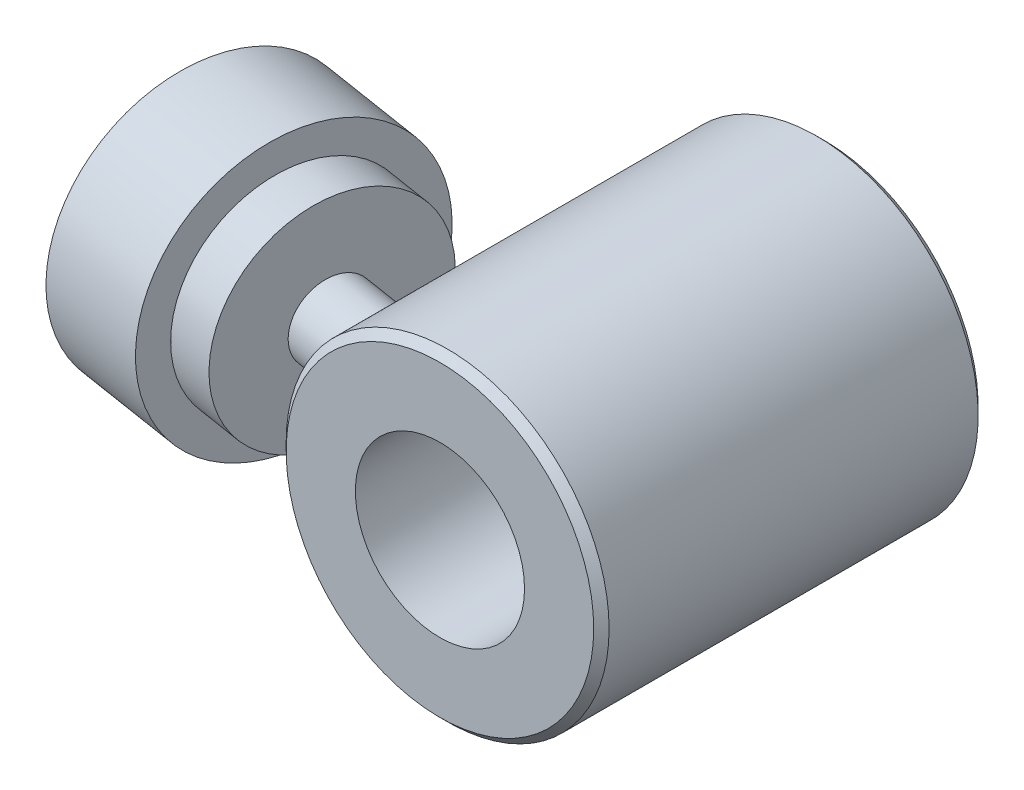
ISO-10303-21;
HEADER;
FILE_DESCRIPTION(('STEP AP214'),'2;1');
FILE_NAME('part.step','',(''),(''),'','','');
FILE_SCHEMA(('AUTOMOTIVE_DESIGN { 1 0 10303 214 1 1 1 1 }'));
ENDSEC;
DATA;
#1=APPLICATION_CONTEXT('core data for automotive mechanical design processes');
#2=APPLICATION_PROTOCOL_DEFINITION('international standard','automotive_design',2000,#1);
#3=PRODUCT_CONTEXT('',#1,'mechanical');
#4=PRODUCT('Part','Part','',(#3));
#5=PRODUCT_RELATED_PRODUCT_CATEGORY('part','',(#4));
#6=PRODUCT_DEFINITION_FORMATION('','',#4);
#7=PRODUCT_DEFINITION_CONTEXT('part definition',#1,'design');
#8=PRODUCT_DEFINITION('design','',#6,#7);
#9=PRODUCT_DEFINITION_SHAPE('','',#8);
#10=(LENGTH_UNIT() NAMED_UNIT(*) SI_UNIT(.MILLI.,.METRE.));
#11=(NAMED_UNIT(*) PLANE_ANGLE_UNIT() SI_UNIT($,.RADIAN.));
#12=(NAMED_UNIT(*) SI_UNIT($,.STERADIAN.) SOLID_ANGLE_UNIT());
#13=UNCERTAINTY_MEASURE_WITH_UNIT(LENGTH_MEASURE(1.E-05),#10,'distance_accuracy_value','');
#14=(GEOMETRIC_REPRESENTATION_CONTEXT(3) GLOBAL_UNCERTAINTY_ASSIGNED_CONTEXT((#13)) GLOBAL_UNIT_ASSIGNED_CONTEXT((#10,
#11,#12)) REPRESENTATION_CONTEXT('',''));
#15=CARTESIAN_POINT('',(0.,0.,0.));
#16=DIRECTION('',(0.,0.,1.));
#17=DIRECTION('',(1.,0.,0.));
#18=AXIS2_PLACEMENT_3D('',#15,#16,#17);
#19=CARTESIAN_POINT('',(-37.6273602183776,0.,44.0222989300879));
#20=DIRECTION('',(0.15643446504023,0.,-0.987688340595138));
#21=DIRECTION('',(0.987688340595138,0.,0.15643446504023));
#22=AXIS2_PLACEMENT_3D('',#19,#20,#21);
#23=PLANE('',#22);
#24=DIRECTION('',(0.,-1.,0.));
#25=VECTOR('',#24,1.);
#26=CARTESIAN_POINT('',(-39.5335987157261,0.,43.7203804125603));
#27=LINE('',#26,#25);
#28=CARTESIAN_POINT('',(-39.5335987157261,0.524499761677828,43.7203804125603));
#29=VERTEX_POINT('',#28);
#30=CARTESIAN_POINT('',(-39.5335987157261,-0.524499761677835,43.7203804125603));
#31=VERTEX_POINT('',#30);
#32=EDGE_CURVE('E174',#29,#31,#27,.T.);
#33=ORIENTED_EDGE('',*,*,#32,.F.);
#34=CARTESIAN_POINT('',(-37.6273602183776,0.,44.0222989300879));
#35=DIRECTION('',(0.15643446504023,0.,-0.987688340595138));
#36=DIRECTION('',(-0.987688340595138,0.,-0.15643446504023));
#37=AXIS2_PLACEMENT_3D('',#34,#35,#36);
#38=CIRCLE('',#37,2.);
#39=EDGE_CURVE('E10',#31,#29,#38,.T.);
#40=ORIENTED_EDGE('',*,*,#39,.F.);
#41=EDGE_LOOP('',(#33,#40));
#42=FACE_BOUND('',#41,.T.);
#43=ADVANCED_FACE('F16',(#42),#23,.F.);
#44=CARTESIAN_POINT('',(-33.7164985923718,0.,19.3300904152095));
#45=DIRECTION('',(0.15643446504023,0.,-0.987688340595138));
#46=DIRECTION('',(0.987688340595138,0.,0.15643446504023));
#47=AXIS2_PLACEMENT_3D('',#44,#45,#46);
#48=PLANE('',#47);
#49=CARTESIAN_POINT('',(-33.7164985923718,0.,19.3300904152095));
#50=DIRECTION('',(0.15643446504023,0.,-0.987688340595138));
#51=DIRECTION('',(-0.987688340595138,0.,-0.15643446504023));
#52=AXIS2_PLACEMENT_3D('',#49,#50,#51);
#53=CIRCLE('',#52,2.);
#54=CARTESIAN_POINT('',(-35.6227370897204,-0.524499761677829,19.0281718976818));
#55=VERTEX_POINT('',#54);
#56=CARTESIAN_POINT('',(-35.6227370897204,0.524499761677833,19.0281718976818));
#57=VERTEX_POINT('',#56);
#58=EDGE_CURVE('E24',#55,#57,#53,.T.);
#59=ORIENTED_EDGE('',*,*,#58,.T.);
#60=DIRECTION('',(0.,-1.,0.));
#61=VECTOR('',#60,1.);
#62=CARTESIAN_POINT('',(-35.6227370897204,0.,19.0281718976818));
#63=LINE('',#62,#61);
#64=EDGE_CURVE('E37',#57,#55,#63,.T.);
#65=ORIENTED_EDGE('',*,*,#64,.T.);
#66=EDGE_LOOP('',(#59,#65));
#67=FACE_BOUND('',#66,.T.);
#68=ADVANCED_FACE('F288',(#67),#48,.T.);
#69=CARTESIAN_POINT('',(-37.236274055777,0.,41.5530780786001));
#70=DIRECTION('',(0.15643446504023,0.,-0.987688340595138));
#71=DIRECTION('',(0.987688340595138,0.,0.15643446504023));
#72=AXIS2_PLACEMENT_3D('',#69,#70,#71);
#73=CYLINDRICAL_SURFACE('',#72,2.);
#74=DIRECTION('',(0.15643446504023,0.,-0.987688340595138));
#75=VECTOR('',#74,1.);
#76=CARTESIAN_POINT('',(-39.1425125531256,-0.524499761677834,41.2511595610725));
#77=LINE('',#76,#75);
#78=CARTESIAN_POINT('',(-39.7667129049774,-0.524499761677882,45.1922054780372));
#79=VERTEX_POINT('',#78);
#80=EDGE_CURVE('E30',#31,#79,#77,.F.);
#81=ORIENTED_EDGE('',*,*,#80,.F.);
#82=ORIENTED_EDGE('',*,*,#39,.T.);
#83=DIRECTION('',(0.15643446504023,0.,-0.987688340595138));
#84=VECTOR('',#83,1.);
#85=CARTESIAN_POINT('',(-39.1425125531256,0.524499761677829,41.2511595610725));
#86=LINE('',#85,#84);
#87=CARTESIAN_POINT('',(-39.7667129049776,0.524499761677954,45.1922054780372));
#88=VERTEX_POINT('',#87);
#89=EDGE_CURVE('E170',#88,#29,#86,.T.);
#90=ORIENTED_EDGE('',*,*,#89,.F.);
#91=CARTESIAN_POINT('',(-39.8373885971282,0.,45.1909625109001));
#92=CARTESIAN_POINT('',(-39.8373837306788,0.111730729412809,45.1909615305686));
#93=CARTESIAN_POINT('',(-39.8278984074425,0.223527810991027,45.1910971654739));
#94=CARTESIAN_POINT('',(-39.7902317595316,0.444001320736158,45.1917424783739));
#95=CARTESIAN_POINT('',(-39.7620318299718,0.55267453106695,45.1922525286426));
#96=CARTESIAN_POINT('',(-39.6878423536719,0.763677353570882,45.1939480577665));
#97=CARTESIAN_POINT('',(-39.6418658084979,0.866011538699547,45.1951330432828));
#98=CARTESIAN_POINT('',(-39.5335359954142,1.06155930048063,45.1986297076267));
#99=CARTESIAN_POINT('',(-39.4711851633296,1.15477423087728,45.2009412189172));
#100=CARTESIAN_POINT('',(-39.331500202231,1.33011730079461,45.2072522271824));
#101=CARTESIAN_POINT('',(-39.2540733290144,1.41217118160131,45.2112623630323));
#102=CARTESIAN_POINT('',(-39.0867447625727,1.56222258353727,45.2215354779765));
#103=CARTESIAN_POINT('',(-38.9968423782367,1.63021932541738,45.2277985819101));
#104=CARTESIAN_POINT('',(-38.8067251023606,1.75051175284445,45.243098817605));
#105=CARTESIAN_POINT('',(-38.7064661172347,1.80273625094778,45.2521481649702));
#106=CARTESIAN_POINT('',(-38.4988861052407,1.88954690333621,45.273334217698));
#107=CARTESIAN_POINT('',(-38.3915654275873,1.92413392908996,45.2854707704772));
#108=CARTESIAN_POINT('',(-38.1737468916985,1.97445864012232,45.3128058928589));
#109=CARTESIAN_POINT('',(-38.0632756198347,1.9903229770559,45.3279830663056));
#110=CARTESIAN_POINT('',(-37.8416729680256,2.00314420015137,45.3612111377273));
#111=CARTESIAN_POINT('',(-37.7305416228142,2.00010207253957,45.3792618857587));
#112=CARTESIAN_POINT('',(-37.5116451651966,1.9753003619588,45.4175329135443));
#113=CARTESIAN_POINT('',(-37.4038610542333,1.95368136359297,45.43773590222));
#114=CARTESIAN_POINT('',(-37.1937865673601,1.89255944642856,45.4795898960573));
#115=CARTESIAN_POINT('',(-37.091496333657,1.85305606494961,45.5012409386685));
#116=CARTESIAN_POINT('',(-36.8948205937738,1.75713904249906,45.5450177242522));
#117=CARTESIAN_POINT('',(-36.800464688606,1.70066538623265,45.567144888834));
#118=CARTESIAN_POINT('',(-36.6225561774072,1.57245369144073,45.6106010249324));
#119=CARTESIAN_POINT('',(-36.5390042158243,1.50071474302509,45.6319299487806));
#120=CARTESIAN_POINT('',(-36.384178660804,1.34323491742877,45.6727336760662));
#121=CARTESIAN_POINT('',(-36.3130231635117,1.2573730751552,45.6921899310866));
#122=CARTESIAN_POINT('',(-36.1858161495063,1.07449831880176,45.7278101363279));
#123=CARTESIAN_POINT('',(-36.1297646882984,0.97748536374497,45.7439740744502));
#124=CARTESIAN_POINT('',(-36.0342587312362,0.774962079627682,45.7719588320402));
#125=CARTESIAN_POINT('',(-35.9948126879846,0.669447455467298,45.7837774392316));
#126=CARTESIAN_POINT('',(-35.9336635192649,0.452966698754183,45.8022548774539));
#127=CARTESIAN_POINT('',(-35.9119593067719,0.342000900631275,45.8089140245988));
#128=CARTESIAN_POINT('',(-35.8870208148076,0.118800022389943,45.816575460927));
#129=CARTESIAN_POINT('',(-35.8836277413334,0.00658433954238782,45.8176263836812));
#130=CARTESIAN_POINT('',(-35.8949806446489,-0.216834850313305,45.8141296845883));
#131=CARTESIAN_POINT('',(-35.9097261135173,-0.328038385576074,45.809582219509));
#132=CARTESIAN_POINT('',(-35.9568334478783,-0.545782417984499,45.7952346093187));
#133=CARTESIAN_POINT('',(-35.9891183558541,-0.652341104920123,45.7854574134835));
#134=CARTESIAN_POINT('',(-36.0703656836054,-0.858342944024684,45.7613205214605));
#135=CARTESIAN_POINT('',(-36.1193288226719,-0.957785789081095,45.746960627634));
#136=CARTESIAN_POINT('',(-36.2330029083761,-1.14745969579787,45.7144818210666));
#137=CARTESIAN_POINT('',(-36.2978162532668,-1.23762521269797,45.6963385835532));
#138=CARTESIAN_POINT('',(-36.4413109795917,-1.40551529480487,45.6574943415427));
#139=CARTESIAN_POINT('',(-36.519993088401,-1.4832392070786,45.6367932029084));
#140=CARTESIAN_POINT('',(-36.6898085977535,-1.62463364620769,45.5939122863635));
#141=CARTESIAN_POINT('',(-36.7810310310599,-1.68819430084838,45.5717225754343));
#142=CARTESIAN_POINT('',(-36.9730272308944,-1.79869568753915,45.5272725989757));
#143=CARTESIAN_POINT('',(-37.0738007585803,-1.84563683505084,45.5050123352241));
#144=CARTESIAN_POINT('',(-37.2817940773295,-1.92139410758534,45.4616559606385));
#145=CARTESIAN_POINT('',(-37.3889915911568,-1.9502693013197,45.440556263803));
#146=CARTESIAN_POINT('',(-37.6071138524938,-1.98926373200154,45.400398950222));
#147=CARTESIAN_POINT('',(-37.7180383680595,-1.99938413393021,45.3813412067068));
#148=CARTESIAN_POINT('',(-37.9394053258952,-2.00055590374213,45.34610879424));
#149=CARTESIAN_POINT('',(-38.0498429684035,-1.99177997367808,45.3299094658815));
#150=CARTESIAN_POINT('',(-38.2680788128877,-1.955776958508,45.3005349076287));
#151=CARTESIAN_POINT('',(-38.3758770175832,-1.9285498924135,45.2873596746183));
#152=CARTESIAN_POINT('',(-38.5856821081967,-1.85647645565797,45.2640846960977));
#153=CARTESIAN_POINT('',(-38.6876925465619,-1.81164102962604,45.2539830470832));
#154=CARTESIAN_POINT('',(-38.883104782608,-1.7056406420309,45.236620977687));
#155=CARTESIAN_POINT('',(-38.9765063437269,-1.6444752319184,45.2293606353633));
#156=CARTESIAN_POINT('',(-39.1528324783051,-1.50691947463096,45.2172104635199));
#157=CARTESIAN_POINT('',(-39.2356585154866,-1.43040092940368,45.2123418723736));
#158=CARTESIAN_POINT('',(-39.3874913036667,-1.26458151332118,45.2045271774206));
#159=CARTESIAN_POINT('',(-39.4564948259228,-1.17527766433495,45.2015815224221));
#160=CARTESIAN_POINT('',(-39.5789242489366,-0.985903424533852,45.1970366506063));
#161=CARTESIAN_POINT('',(-39.6322710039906,-0.885781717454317,45.1954442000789));
#162=CARTESIAN_POINT('',(-39.7212353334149,-0.678021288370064,45.1931169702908));
#163=CARTESIAN_POINT('',(-39.7568715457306,-0.570390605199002,45.192381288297));
#164=CARTESIAN_POINT('',(-39.8011171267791,-0.385211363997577,45.1915474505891));
#165=CARTESIAN_POINT('',(-39.8146974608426,-0.308813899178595,45.191321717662));
#166=CARTESIAN_POINT('',(-39.8328348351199,-0.154954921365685,45.19102958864));
#167=CARTESIAN_POINT('',(-39.8373919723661,-0.077493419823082,45.1909631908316));
#168=CARTESIAN_POINT('',(-39.8373885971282,0.,45.1909625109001));
#169=B_SPLINE_CURVE_WITH_KNOTS('',3,(#91,#92,#93,#94,#95,#96,#97,#98,#99,#100,#101,#102,#103,
#104,#105,#106,#107,#108,#109,#110,#111,#112,#113,#114,#115,#116,#117,#118,#119,#120,#121,#122,
#123,#124,#125,#126,#127,#128,#129,#130,#131,#132,#133,#134,#135,#136,#137,#138,#139,#140,#141,
#142,#143,#144,#145,#146,#147,#148,#149,#150,#151,#152,#153,#154,#155,#156,#157,#158,#159,#160,
#161,#162,#163,#164,#165,#166,#167,#168),.UNSPECIFIED.,.T.,.F.,(4,2,2,2,2,2,2,2,2,2,2,2,2,2,2,2,
2,2,2,2,2,2,2,2,2,2,2,2,2,2,2,2,2,2,2,2,2,2,4),(0.,0.334909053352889,0.670151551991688,
1.00514932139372,1.34009728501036,1.67717486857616,2.0142711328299,2.35286688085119,
2.69144589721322,3.02772118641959,3.36397893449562,3.69771416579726,4.03145803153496,
4.36639635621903,4.70135465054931,5.03934756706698,5.37734172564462,5.71550772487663,
6.05365300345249,6.38886112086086,6.72405985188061,7.05779957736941,7.39155369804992,
7.72752375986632,8.06351144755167,8.40202124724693,8.74052258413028,9.07791128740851,
9.41527903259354,9.74957651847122,10.0838736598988,10.4179633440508,10.752062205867,
11.0890764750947,11.4261693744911,11.7649380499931,12.1033494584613,12.3356358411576,
12.5679197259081),.UNSPECIFIED.);
#170=CARTESIAN_POINT('',(-39.8373885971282,0.,45.1909625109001));
#171=VERTEX_POINT('',#170);
#172=EDGE_CURVE('E301',#171,#88,#169,.T.);
#173=ORIENTED_EDGE('',*,*,#172,.F.);
#174=EDGE_CURVE('E307',#79,#171,#169,.T.);
#175=ORIENTED_EDGE('',*,*,#174,.F.);
#176=EDGE_LOOP('',(#81,#82,#90,#173,#175));
#177=FACE_BOUND('',#176,.T.);
#178=ADVANCED_FACE('F294',(#177),#73,.F.);
#179=DIRECTION('',(0.15643446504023,0.,-0.987688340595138));
#180=VECTOR('',#179,1.);
#181=CARTESIAN_POINT('',(-39.1425125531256,-0.524499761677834,41.2511595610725));
#182=LINE('',#181,#180);
#183=CARTESIAN_POINT('',(-35.3896229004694,-0.524499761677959,17.5563468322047));
#184=VERTEX_POINT('',#183);
#185=EDGE_CURVE('E167',#184,#55,#182,.F.);
#186=ORIENTED_EDGE('',*,*,#185,.F.);
#187=CARTESIAN_POINT('',(-35.4572235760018,0.,17.5356889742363));
#188=CARTESIAN_POINT('',(-35.4572192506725,-0.111730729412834,17.5356914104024));
#189=CARTESIAN_POINT('',(-35.4481562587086,-0.223527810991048,17.5384935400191));
#190=CARTESIAN_POINT('',(-35.4121337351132,-0.444001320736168,17.5495194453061));
#191=CARTESIAN_POINT('',(-35.3851563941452,-0.552674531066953,17.5577486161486));
#192=CARTESIAN_POINT('',(-35.3140740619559,-0.763677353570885,17.5790618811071));
#193=CARTESIAN_POINT('',(-35.2699815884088,-0.866011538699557,17.5921424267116));
#194=CARTESIAN_POINT('',(-35.1658732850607,-1.06155930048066,17.6222926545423));
#195=CARTESIAN_POINT('',(-35.1058598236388,-1.15477423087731,17.6393617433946));
#196=CARTESIAN_POINT('',(-34.971061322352,-1.33011730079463,17.6765246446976));
#197=CARTESIAN_POINT('',(-34.8961847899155,-1.41217118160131,17.6966369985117));
#198=CARTESIAN_POINT('',(-34.7338712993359,-1.56222258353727,17.7385740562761));
#199=CARTESIAN_POINT('',(-34.6464336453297,-1.6302193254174,17.7603988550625));
#200=CARTESIAN_POINT('',(-34.4608933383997,-1.75051175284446,17.804596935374));
#201=CARTESIAN_POINT('',(-34.3627449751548,-1.80273625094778,17.8269722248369));
#202=CARTESIAN_POINT('',(-34.1587778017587,-1.88954690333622,17.8709688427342));
#203=CARTESIAN_POINT('',(-34.0529593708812,-1.92413392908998,17.8925902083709));
#204=CARTESIAN_POINT('',(-33.8373546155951,-1.97445864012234,17.9339025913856));
#205=CARTESIAN_POINT('',(-33.727600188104,-1.99032297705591,17.9536057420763));
#206=CARTESIAN_POINT('',(-33.5065755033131,-2.00314420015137,17.9904829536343));
#207=CARTESIAN_POINT('',(-33.3953053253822,-2.0001020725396,18.007657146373));
#208=CARTESIAN_POINT('',(-33.1752960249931,-1.97530036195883,18.0389019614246));
#209=CARTESIAN_POINT('',(-33.0665441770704,-1.95368136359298,18.0529948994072));
#210=CARTESIAN_POINT('',(-32.8538178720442,-1.89255944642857,18.0781059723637));
#211=CARTESIAN_POINT('',(-32.7498435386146,-1.85305606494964,18.0891240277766));
#212=CARTESIAN_POINT('',(-32.5492660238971,-1.75713904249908,18.1082659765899));
#213=CARTESIAN_POINT('',(-32.4526905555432,-1.70066538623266,18.1163793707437));
#214=CARTESIAN_POINT('',(-32.2700608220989,-1.57245369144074,18.1300268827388));
#215=CARTESIAN_POINT('',(-32.1840071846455,-1.50071474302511,18.1355608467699));
#216=CARTESIAN_POINT('',(-32.0241502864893,-1.34323491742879,18.1445979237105));
#217=CARTESIAN_POINT('',(-31.950465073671,-1.25737307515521,18.1480821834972));
#218=CARTESIAN_POINT('',(-31.8184767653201,-1.07449831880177,18.153514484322));
#219=CARTESIAN_POINT('',(-31.7601737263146,-0.97748536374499,18.1554625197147));
#220=CARTESIAN_POINT('',(-31.6606943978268,-0.774962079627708,18.158360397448));
#221=CARTESIAN_POINT('',(-31.6195268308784,-0.66944745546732,18.1593097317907));
#222=CARTESIAN_POINT('',(-31.5556606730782,-0.452966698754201,18.1606327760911));
#223=CARTESIAN_POINT('',(-31.5329609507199,-0.342000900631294,18.161006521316));
#224=CARTESIAN_POINT('',(-31.5068755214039,-0.11880002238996,18.1614264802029));
#225=CARTESIAN_POINT('',(-31.5033237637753,-0.00658433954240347,18.1614755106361));
#226=CARTESIAN_POINT('',(-31.5152015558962,0.216834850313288,18.1612928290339));
#227=CARTESIAN_POINT('',(-31.5306305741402,0.328038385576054,18.1610611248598));
#228=CARTESIAN_POINT('',(-31.5798659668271,0.545782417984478,18.1601495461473));
#229=CARTESIAN_POINT('',(-31.6135920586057,0.652341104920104,18.1594716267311));
#230=CARTESIAN_POINT('',(-31.6983215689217,0.858342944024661,18.15732037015));
#231=CARTESIAN_POINT('',(-31.749325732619,0.957785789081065,18.1558469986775));
#232=CARTESIAN_POINT('',(-31.8674727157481,1.14745969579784,18.1516089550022));
#233=CARTESIAN_POINT('',(-31.9347204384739,1.23762521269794,18.1488357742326));
#234=CARTESIAN_POINT('',(-32.0831955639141,1.40551529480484,18.1414365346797));
#235=CARTESIAN_POINT('',(-32.164423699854,1.48323920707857,18.1368103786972));
#236=CARTESIAN_POINT('',(-32.3391787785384,1.62463364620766,18.1251166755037));
#237=CARTESIAN_POINT('',(-32.4327934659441,1.68819430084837,18.1180310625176));
#238=CARTESIAN_POINT('',(-32.6291285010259,1.79869568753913,18.1009754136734));
#239=CARTESIAN_POINT('',(-32.7318486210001,1.84563683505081,18.0910054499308));
#240=CARTESIAN_POINT('',(-32.9430598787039,1.92139410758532,18.0679663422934));
#241=CARTESIAN_POINT('',(-33.0515309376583,1.9502693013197,18.0549074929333));
#242=CARTESIAN_POINT('',(-33.2713868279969,1.98926373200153,18.0256958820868));
#243=CARTESIAN_POINT('',(-33.3827714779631,1.99938413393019,18.0095433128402));
#244=CARTESIAN_POINT('',(-33.6041913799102,2.00055590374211,17.9746451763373));
#245=CARTESIAN_POINT('',(-33.7142296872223,1.99177997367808,17.9559245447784));
#246=CARTESIAN_POINT('',(-33.9308615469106,1.955776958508,17.9164228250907));
#247=CARTESIAN_POINT('',(-34.0374551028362,1.92854989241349,17.8956417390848));
#248=CARTESIAN_POINT('',(-34.2441839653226,1.85647645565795,17.8529442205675));
#249=CARTESIAN_POINT('',(-34.3443232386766,1.81164102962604,17.8310285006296));
#250=CARTESIAN_POINT('',(-34.535536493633,1.7056406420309,17.7871551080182));
#251=CARTESIAN_POINT('',(-34.6266102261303,1.64447523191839,17.7651974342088));
#252=CARTESIAN_POINT('',(-34.7980609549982,1.50691947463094,17.7222651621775));
#253=CARTESIAN_POINT('',(-34.8783376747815,1.43040092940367,17.7013008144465));
#254=CARTESIAN_POINT('',(-35.0251541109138,1.26458151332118,17.6618141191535));
#255=CARTESIAN_POINT('',(-35.0916906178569,1.17527766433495,17.6432923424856));
#256=CARTESIAN_POINT('',(-35.2095323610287,0.98590342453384,17.609782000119));
#257=CARTESIAN_POINT('',(-35.2607602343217,0.885781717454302,17.5948114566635));
#258=CARTESIAN_POINT('',(-35.3460894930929,0.67802128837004,17.5695332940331));
#259=CARTESIAN_POINT('',(-35.3802088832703,0.570390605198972,17.5592207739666));
#260=CARTESIAN_POINT('',(-35.422546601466,0.385211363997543,17.5463411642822));
#261=CARTESIAN_POINT('',(-35.4355320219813,0.308813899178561,17.5423592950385));
#262=CARTESIAN_POINT('',(-35.4528719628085,0.154954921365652,17.5370323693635));
#263=CARTESIAN_POINT('',(-35.4572265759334,0.0774934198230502,17.5356872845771));
#264=CARTESIAN_POINT('',(-35.4572235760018,0.,17.5356889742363));
#265=B_SPLINE_CURVE_WITH_KNOTS('',3,(#187,#188,#189,#190,#191,#192,#193,#194,#195,#196,#197,
#198,#199,#200,#201,#202,#203,#204,#205,#206,#207,#208,#209,#210,#211,#212,#213,#214,#215,#216,
#217,#218,#219,#220,#221,#222,#223,#224,#225,#226,#227,#228,#229,#230,#231,#232,#233,#234,#235,
#236,#237,#238,#239,#240,#241,#242,#243,#244,#245,#246,#247,#248,#249,#250,#251,#252,#253,#254,
#255,#256,#257,#258,#259,#260,#261,#262,#263,#264),.UNSPECIFIED.,.T.,.F.,(4,2,2,2,2,2,2,2,2,2,2,
2,2,2,2,2,2,2,2,2,2,2,2,2,2,2,2,2,2,2,2,2,2,2,2,2,2,2,4),(0.,0.334909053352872,
0.670151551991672,1.0051493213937,1.34009728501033,1.67717486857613,2.01427113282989,
2.35286688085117,2.69144589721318,3.02772118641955,3.36397893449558,3.69771416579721,
4.03145803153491,4.366396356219,4.70135465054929,5.03934756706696,5.37734172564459,
5.7155077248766,6.05365300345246,6.38886112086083,6.72405985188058,7.05779957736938,
7.39155369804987,7.72752375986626,8.06351144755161,8.40202124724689,8.74052258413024,
9.07791128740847,9.41527903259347,9.74957651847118,10.0838736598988,10.4179633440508,
10.752062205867,11.0890764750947,11.4261693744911,11.7649380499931,12.1033494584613,
12.3356358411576,12.5679197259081),.UNSPECIFIED.);
#266=CARTESIAN_POINT('',(-35.4572235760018,0.,17.5356889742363));
#267=VERTEX_POINT('',#266);
#268=EDGE_CURVE('E139',#267,#184,#265,.T.);
#269=ORIENTED_EDGE('',*,*,#268,.F.);
#270=CARTESIAN_POINT('',(-35.3896229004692,0.524499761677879,17.5563468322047));
#271=VERTEX_POINT('',#270);
#272=EDGE_CURVE('E134',#271,#267,#265,.T.);
#273=ORIENTED_EDGE('',*,*,#272,.F.);
#274=DIRECTION('',(0.15643446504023,0.,-0.987688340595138));
#275=VECTOR('',#274,1.);
#276=CARTESIAN_POINT('',(-39.1425125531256,0.524499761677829,41.2511595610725));
#277=LINE('',#276,#275);
#278=EDGE_CURVE('E137',#57,#271,#277,.T.);
#279=ORIENTED_EDGE('',*,*,#278,.F.);
#280=ORIENTED_EDGE('',*,*,#58,.F.);
#281=EDGE_LOOP('',(#186,#269,#273,#279,#280));
#282=FACE_BOUND('',#281,.T.);
#283=ADVANCED_FACE('F136',(#282),#73,.F.);
#284=CARTESIAN_POINT('',(-43.326514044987,0.,30.4638275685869));
#285=DIRECTION('',(0.987688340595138,0.,0.156434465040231));
#286=DIRECTION('',(-0.156434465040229,0.,0.987688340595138));
#287=AXIS2_PLACEMENT_3D('',#284,#285,#286);
#288=CYLINDRICAL_SURFACE('',#287,5.);
#289=CARTESIAN_POINT('',(-21.,0.,39.06232562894));
#290=CARTESIAN_POINT('',(-20.9999947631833,0.28069498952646,39.0623179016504));
#291=CARTESIAN_POINT('',(-20.9943167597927,0.561494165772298,39.0392231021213));
#292=CARTESIAN_POINT('',(-20.9722013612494,1.11521600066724,38.9473965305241));
#293=CARTESIAN_POINT('',(-20.955757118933,1.38813353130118,38.8786357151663));
#294=CARTESIAN_POINT('',(-20.9139040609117,1.91814423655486,38.6972613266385));
#295=CARTESIAN_POINT('',(-20.8884987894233,2.17524362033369,38.5846650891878));
#296=CARTESIAN_POINT('',(-20.8314930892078,2.66647896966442,38.3184772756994));
#297=CARTESIAN_POINT('',(-20.7998931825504,2.90061686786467,38.1648891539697));
#298=CARTESIAN_POINT('',(-20.7339173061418,3.33978269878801,37.8202738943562));
#299=CARTESIAN_POINT('',(-20.6995362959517,3.54475583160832,37.6291778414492));
#300=CARTESIAN_POINT('',(-20.6319231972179,3.9191879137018,37.214703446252));
#301=CARTESIAN_POINT('',(-20.5986910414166,4.08864894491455,36.9913269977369));
#302=CARTESIAN_POINT('',(-20.5374481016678,4.3859045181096,36.5203356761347));
#303=CARTESIAN_POINT('',(-20.5093966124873,4.51403036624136,36.2729353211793));
#304=CARTESIAN_POINT('',(-20.4613904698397,4.72688981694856,35.7594143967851));
#305=CARTESIAN_POINT('',(-20.4414347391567,4.8116291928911,35.4932963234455));
#306=CARTESIAN_POINT('',(-20.412053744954,4.93477930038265,34.9539395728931));
#307=CARTESIAN_POINT('',(-20.402485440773,4.97381993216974,34.6808520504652));
#308=CARTESIAN_POINT('',(-20.3942979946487,5.0072852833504,34.1318195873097));
#309=CARTESIAN_POINT('',(-20.3956794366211,5.00170762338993,33.8558744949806));
#310=CARTESIAN_POINT('',(-20.4091045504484,4.94663914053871,33.305686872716));
#311=CARTESIAN_POINT('',(-20.4212637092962,4.89667266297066,33.0314952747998));
#312=CARTESIAN_POINT('',(-20.4548747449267,4.754301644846,32.4949508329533));
#313=CARTESIAN_POINT('',(-20.4763287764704,4.66188726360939,32.2326007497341));
#314=CARTESIAN_POINT('',(-20.5271627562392,4.43282015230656,31.7157097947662));
#315=CARTESIAN_POINT('',(-20.5568333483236,4.29449861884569,31.4619384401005));
#316=CARTESIAN_POINT('',(-20.6203350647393,3.97839696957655,30.9806017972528));
#317=CARTESIAN_POINT('',(-20.6541672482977,3.80060679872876,30.7530432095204));
#318=CARTESIAN_POINT('',(-20.7056799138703,3.50502690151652,30.4334004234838));
#319=CARTESIAN_POINT('',(-20.7232243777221,3.4000346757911,30.3291970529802));
#320=CARTESIAN_POINT('',(-20.7579092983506,3.18142025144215,30.1302268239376));
#321=CARTESIAN_POINT('',(-20.7750499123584,3.06780148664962,30.0354562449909));
#322=CARTESIAN_POINT('',(-20.8084243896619,2.83259383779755,29.8561311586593));
#323=CARTESIAN_POINT('',(-20.8246579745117,2.71100253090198,29.771579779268));
#324=CARTESIAN_POINT('',(-20.855712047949,2.46072395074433,29.6135470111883));
#325=CARTESIAN_POINT('',(-20.8705331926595,2.33204001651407,29.5400604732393));
#326=CARTESIAN_POINT('',(-20.8978713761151,2.07254815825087,29.4069827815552));
#327=CARTESIAN_POINT('',(-20.9104459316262,1.94193218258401,29.3470292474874));
#328=CARTESIAN_POINT('',(-20.933453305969,1.67581526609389,29.2388312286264));
#329=CARTESIAN_POINT('',(-20.9438870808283,1.54031653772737,29.1905815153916));
#330=CARTESIAN_POINT('',(-20.9622911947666,1.26543155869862,29.1063124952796));
#331=CARTESIAN_POINT('',(-20.9702620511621,1.12604613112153,29.0702906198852));
#332=CARTESIAN_POINT('',(-20.9834866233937,0.844479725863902,29.0108984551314));
#333=CARTESIAN_POINT('',(-20.9887405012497,0.702298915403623,28.9875274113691));
#334=CARTESIAN_POINT('',(-20.9961084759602,0.425772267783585,28.9548430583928));
#335=CARTESIAN_POINT('',(-20.9984068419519,0.291528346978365,28.9447040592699));
#336=CARTESIAN_POINT('',(-21.0004184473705,0.0225963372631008,28.9358271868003));
#337=CARTESIAN_POINT('',(-21.0001308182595,-0.112091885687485,28.9370931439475));
#338=CARTESIAN_POINT('',(-20.9969771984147,-0.38077548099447,28.9510184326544));
#339=CARTESIAN_POINT('',(-20.9941125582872,-0.514771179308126,28.963671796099));
#340=CARTESIAN_POINT('',(-20.9858884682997,-0.781189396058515,29.0002269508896));
#341=CARTESIAN_POINT('',(-20.9805280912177,-0.913611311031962,29.0241329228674));
#342=CARTESIAN_POINT('',(-20.9676433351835,-1.17227634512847,29.0821314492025));
#343=CARTESIAN_POINT('',(-20.9601823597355,-1.29858930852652,29.1159265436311));
#344=CARTESIAN_POINT('',(-20.9432441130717,-1.54796121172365,29.193574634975));
#345=CARTESIAN_POINT('',(-20.9337661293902,-1.67101898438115,29.2374311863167));
#346=CARTESIAN_POINT('',(-20.902664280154,-2.03405978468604,29.3834953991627));
#347=CARTESIAN_POINT('',(-20.8783607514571,-2.26813365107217,29.5002483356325));
#348=CARTESIAN_POINT('',(-20.8239833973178,-2.72331728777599,29.7736925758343));
#349=CARTESIAN_POINT('',(-20.7937222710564,-2.94357166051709,29.9317577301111));
#350=CARTESIAN_POINT('',(-20.7311243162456,-3.35619944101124,30.2805562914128));
#351=CARTESIAN_POINT('',(-20.6987868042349,-3.54856359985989,30.4713004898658));
#352=CARTESIAN_POINT('',(-20.6331413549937,-3.91279390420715,30.8935593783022));
#353=CARTESIAN_POINT('',(-20.5999042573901,-4.08255324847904,31.126904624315));
#354=CARTESIAN_POINT('',(-20.538290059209,-4.38201811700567,31.6186518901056));
#355=CARTESIAN_POINT('',(-20.5099140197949,-4.51171490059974,31.8770593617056));
#356=CARTESIAN_POINT('',(-20.4605935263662,-4.73044531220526,32.4196872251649));
#357=CARTESIAN_POINT('',(-20.4398760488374,-4.81825651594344,32.704423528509));
#358=CARTESIAN_POINT('',(-20.4097214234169,-4.94444733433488,33.2852368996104));
#359=CARTESIAN_POINT('',(-20.4002818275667,-4.98283767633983,33.5813114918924));
#360=CARTESIAN_POINT('',(-20.3942160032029,-5.00760510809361,34.1669886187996));
#361=CARTESIAN_POINT('',(-20.3972180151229,-4.99549121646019,34.4565226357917));
#362=CARTESIAN_POINT('',(-20.4150573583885,-4.92207798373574,35.0289021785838));
#363=CARTESIAN_POINT('',(-20.429891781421,-4.86079072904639,35.3117493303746));
#364=CARTESIAN_POINT('',(-20.4688954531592,-4.69374868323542,35.850879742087));
#365=CARTESIAN_POINT('',(-20.4926695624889,-4.5898613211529,36.1077722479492));
#366=CARTESIAN_POINT('',(-20.5468825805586,-4.34071312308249,36.5998603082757));
#367=CARTESIAN_POINT('',(-20.577321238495,-4.19545384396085,36.8350566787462));
#368=CARTESIAN_POINT('',(-20.6412470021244,-3.86864153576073,37.2759983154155));
#369=CARTESIAN_POINT('',(-20.6747148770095,-3.68730976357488,37.4819106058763));
#370=CARTESIAN_POINT('',(-20.741198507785,-3.29281333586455,37.8607182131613));
#371=CARTESIAN_POINT('',(-20.7742141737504,-3.07964244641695,38.033607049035));
#372=CARTESIAN_POINT('',(-20.8367148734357,-2.62391730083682,38.344381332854));
#373=CARTESIAN_POINT('',(-20.866139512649,-2.38097022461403,38.4817027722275));
#374=CARTESIAN_POINT('',(-20.9176536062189,-1.87515863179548,38.7143920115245));
#375=CARTESIAN_POINT('',(-20.9397474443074,-1.61230613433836,38.809784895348));
#376=CARTESIAN_POINT('',(-20.9709948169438,-1.12488447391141,38.9424844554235));
#377=CARTESIAN_POINT('',(-20.981803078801,-0.902445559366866,38.9873533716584));
#378=CARTESIAN_POINT('',(-20.9963077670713,-0.453360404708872,39.0472770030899));
#379=CARTESIAN_POINT('',(-21.0000042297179,-0.226714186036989,39.0623318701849));
#380=CARTESIAN_POINT('',(-21.,0.,39.06232562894));
#381=B_SPLINE_CURVE_WITH_KNOTS('',3,(#289,#290,#291,#292,#293,#294,#295,#296,#297,#298,#299,
#300,#301,#302,#303,#304,#305,#306,#307,#308,#309,#310,#311,#312,#313,#314,#315,#316,#317,#318,
#319,#320,#321,#322,#323,#324,#325,#326,#327,#328,#329,#330,#331,#332,#333,#334,#335,#336,#337,
#338,#339,#340,#341,#342,#343,#344,#345,#346,#347,#348,#349,#350,#351,#352,#353,#354,#355,#356,
#357,#358,#359,#360,#361,#362,#363,#364,#365,#366,#367,#368,#369,#370,#371,#372,#373,#374,#375,
#376,#377,#378,#379,#380),.UNSPECIFIED.,.T.,.F.,(4,2,2,2,2,2,2,2,2,2,2,2,2,2,2,2,2,2,2,2,2,2,2,
2,2,2,2,2,2,2,2,2,2,2,2,2,2,2,2,2,2,2,2,2,2,4),(0.,0.84126859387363,1.68307274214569,
2.52454431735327,3.36594500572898,4.20890635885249,5.05181827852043,5.88779587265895,
6.72366219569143,7.54786616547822,8.37211408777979,9.20530234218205,10.0386838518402,
10.906470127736,11.7744777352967,12.2209077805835,12.6671610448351,13.1135505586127,
13.5597316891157,13.9919737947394,14.4240224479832,14.8559802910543,15.287912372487,
15.6913493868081,16.0949219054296,16.4982830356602,16.9017941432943,17.2942350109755,
17.6868147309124,18.4712943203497,19.2862118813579,20.1013990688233,20.9688847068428,
21.8365594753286,22.728206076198,23.6196591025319,24.4846702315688,25.3494688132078,
26.1798389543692,27.0101778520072,27.8355725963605,28.6611291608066,29.4990702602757,
30.3365093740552,31.0159960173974,31.6954791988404),.UNSPECIFIED.);
#382=CARTESIAN_POINT('',(-21.,0.,39.06232562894));
#383=VERTEX_POINT('',#382);
#384=EDGE_CURVE('E246',#383,#383,#381,.T.);
#385=ORIENTED_EDGE('',*,*,#384,.T.);
#386=EDGE_LOOP('',(#385));
#387=FACE_BOUND('',#386,.T.);
#388=CARTESIAN_POINT('',(-31.7211760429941,0.,32.3019325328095));
#389=DIRECTION('',(-0.987688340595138,0.,-0.15643446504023));
#390=DIRECTION('',(0.,-1.,0.));
#391=AXIS2_PLACEMENT_3D('',#388,#389,#390);
#392=CIRCLE('',#391,5.);
#393=CARTESIAN_POINT('',(-31.7211760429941,-5.00000000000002,32.3019325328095));
#394=VERTEX_POINT('',#393);
#395=EDGE_CURVE('E180',#394,#394,#392,.T.);
#396=ORIENTED_EDGE('',*,*,#395,.F.);
#397=EDGE_LOOP('',(#396));
#398=FACE_BOUND('',#397,.T.);
#399=ADVANCED_FACE('F283',(#387,#398),#288,.T.);
#400=CARTESIAN_POINT('',(-41.8863876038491,0.,35.754246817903));
#401=DIRECTION('',(-0.987688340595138,0.,-0.156434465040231));
#402=DIRECTION('',(0.156434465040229,0.,-0.987688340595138));
#403=AXIS2_PLACEMENT_3D('',#400,#401,#402);
#404=PLANE('',#403);
#405=DIRECTION('',(0.135476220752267,0.5,-0.855363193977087));
#406=VECTOR('',#405,1.);
#407=CARTESIAN_POINT('',(-41.4953014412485,1.44337567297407,33.2850259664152));
#408=LINE('',#407,#406);
#409=CARTESIAN_POINT('',(-41.4953014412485,1.44337567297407,33.2850259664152));
#410=VERTEX_POINT('',#409);
#411=CARTESIAN_POINT('',(-41.1042152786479,2.88675134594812,30.8158051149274));
#412=VERTEX_POINT('',#411);
#413=EDGE_CURVE('E696',#410,#412,#408,.T.);
#414=ORIENTED_EDGE('',*,*,#413,.T.);
#415=DIRECTION('',(-0.135476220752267,0.5,0.855363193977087));
#416=VECTOR('',#415,1.);
#417=CARTESIAN_POINT('',(-40.7131291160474,1.44337567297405,28.3465842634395));
#418=LINE('',#417,#416);
#419=CARTESIAN_POINT('',(-40.7131291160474,1.44337567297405,28.3465842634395));
#420=VERTEX_POINT('',#419);
#421=EDGE_CURVE('E713',#420,#412,#418,.T.);
#422=ORIENTED_EDGE('',*,*,#421,.F.);
#423=DIRECTION('',(0.,1.,0.));
#424=VECTOR('',#423,1.);
#425=CARTESIAN_POINT('',(-40.7131291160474,-1.44337567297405,28.3465842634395));
#426=LINE('',#425,#424);
#427=CARTESIAN_POINT('',(-40.7131291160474,-1.44337567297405,28.3465842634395));
#428=VERTEX_POINT('',#427);
#429=EDGE_CURVE('E706',#428,#420,#426,.T.);
#430=ORIENTED_EDGE('',*,*,#429,.F.);
#431=DIRECTION('',(-0.135476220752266,-0.5,0.855363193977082));
#432=VECTOR('',#431,1.);
#433=CARTESIAN_POINT('',(-40.7131291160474,-1.44337567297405,28.3465842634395));
#434=LINE('',#433,#432);
#435=CARTESIAN_POINT('',(-41.1042152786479,-2.88675134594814,30.8158051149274));
#436=VERTEX_POINT('',#435);
#437=EDGE_CURVE('E702',#428,#436,#434,.T.);
#438=ORIENTED_EDGE('',*,*,#437,.T.);
#439=DIRECTION('',(0.135476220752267,-0.5,-0.855363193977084));
#440=VECTOR('',#439,1.);
#441=CARTESIAN_POINT('',(-41.4953014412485,-1.44337567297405,33.2850259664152));
#442=LINE('',#441,#440);
#443=CARTESIAN_POINT('',(-41.4953014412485,-1.44337567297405,33.2850259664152));
#444=VERTEX_POINT('',#443);
#445=EDGE_CURVE('E697',#444,#436,#442,.T.);
#446=ORIENTED_EDGE('',*,*,#445,.F.);
#447=DIRECTION('',(0.,1.,0.));
#448=VECTOR('',#447,1.);
#449=CARTESIAN_POINT('',(-41.4953014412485,-1.44337567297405,33.2850259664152));
#450=LINE('',#449,#448);
#451=EDGE_CURVE('E701',#444,#410,#450,.T.);
#452=ORIENTED_EDGE('',*,*,#451,.T.);
#453=EDGE_LOOP('',(#414,#422,#430,#438,#446,#452));
#454=FACE_BOUND('',#453,.T.);
#455=ADVANCED_FACE('F338',(#454),#404,.T.);
#456=CARTESIAN_POINT('',(-40.7131291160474,-1.44337567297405,28.3465842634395));
#457=DIRECTION('',(-0.156434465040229,0.,0.987688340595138));
#458=DIRECTION('',(0.,-1.,0.));
#459=AXIS2_PLACEMENT_3D('',#456,#457,#458);
#460=PLANE('',#459);
#461=DIRECTION('',(-0.987688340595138,0.,-0.156434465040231));
#462=VECTOR('',#461,1.);
#463=CARTESIAN_POINT('',(-40.7131291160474,1.44337567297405,28.3465842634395));
#464=LINE('',#463,#462);
#465=CARTESIAN_POINT('',(-43.1823499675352,1.44337567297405,27.955498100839));
#466=VERTEX_POINT('',#465);
#467=EDGE_CURVE('E689',#420,#466,#464,.T.);
#468=ORIENTED_EDGE('',*,*,#467,.T.);
#469=DIRECTION('',(0.,1.,0.));
#470=VECTOR('',#469,1.);
#471=CARTESIAN_POINT('',(-43.1823499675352,-1.44337567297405,27.955498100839));
#472=LINE('',#471,#470);
#473=CARTESIAN_POINT('',(-43.1823499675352,-1.44337567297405,27.955498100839));
#474=VERTEX_POINT('',#473);
#475=EDGE_CURVE('E729',#474,#466,#472,.T.);
#476=ORIENTED_EDGE('',*,*,#475,.F.);
#477=DIRECTION('',(-0.987688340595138,0.,-0.156434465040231));
#478=VECTOR('',#477,1.);
#479=CARTESIAN_POINT('',(-40.7131291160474,-1.44337567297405,28.3465842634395));
#480=LINE('',#479,#478);
#481=EDGE_CURVE('E686',#428,#474,#480,.T.);
#482=ORIENTED_EDGE('',*,*,#481,.F.);
#483=ORIENTED_EDGE('',*,*,#429,.T.);
#484=EDGE_LOOP('',(#468,#476,#482,#483));
#485=FACE_BOUND('',#484,.T.);
#486=ADVANCED_FACE('F362',(#485),#460,.T.);
#487=CARTESIAN_POINT('',(-40.7131291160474,-1.44337567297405,28.3465842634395));
#488=DIRECTION('',(0.0782172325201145,-0.866025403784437,-0.493844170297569));
#489=DIRECTION('',(0.135476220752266,0.5,-0.855363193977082));
#490=AXIS2_PLACEMENT_3D('',#487,#488,#489);
#491=PLANE('',#490);
#492=ORIENTED_EDGE('',*,*,#481,.T.);
#493=DIRECTION('',(-0.135476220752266,-0.5,0.855363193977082));
#494=VECTOR('',#493,1.);
#495=CARTESIAN_POINT('',(-43.1823499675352,-1.44337567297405,27.955498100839));
#496=LINE('',#495,#494);
#497=CARTESIAN_POINT('',(-43.5734361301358,-2.88675134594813,30.4247189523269));
#498=VERTEX_POINT('',#497);
#499=EDGE_CURVE('E725',#474,#498,#496,.T.);
#500=ORIENTED_EDGE('',*,*,#499,.T.);
#501=DIRECTION('',(-0.987688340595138,0.,-0.156434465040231));
#502=VECTOR('',#501,1.);
#503=CARTESIAN_POINT('',(-41.1042152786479,-2.88675134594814,30.8158051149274));
#504=LINE('',#503,#502);
#505=EDGE_CURVE('E683',#436,#498,#504,.T.);
#506=ORIENTED_EDGE('',*,*,#505,.F.);
#507=ORIENTED_EDGE('',*,*,#437,.F.);
#508=EDGE_LOOP('',(#492,#500,#506,#507));
#509=FACE_BOUND('',#508,.T.);
#510=ADVANCED_FACE('F358',(#509),#491,.F.);
#511=CARTESIAN_POINT('',(-41.4953014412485,-1.44337567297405,33.2850259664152));
#512=DIRECTION('',(0.0782172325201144,0.866025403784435,-0.493844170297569));
#513=DIRECTION('',(-0.135476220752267,0.5,0.855363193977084));
#514=AXIS2_PLACEMENT_3D('',#511,#512,#513);
#515=PLANE('',#514);
#516=ORIENTED_EDGE('',*,*,#505,.T.);
#517=DIRECTION('',(0.135476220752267,-0.5,-0.855363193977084));
#518=VECTOR('',#517,1.);
#519=CARTESIAN_POINT('',(-43.9645222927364,-1.44337567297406,32.8939398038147));
#520=LINE('',#519,#518);
#521=CARTESIAN_POINT('',(-43.9645222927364,-1.44337567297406,32.8939398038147));
#522=VERTEX_POINT('',#521);
#523=EDGE_CURVE('E720',#522,#498,#520,.T.);
#524=ORIENTED_EDGE('',*,*,#523,.F.);
#525=DIRECTION('',(-0.987688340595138,0.,-0.156434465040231));
#526=VECTOR('',#525,1.);
#527=CARTESIAN_POINT('',(-41.4953014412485,-1.44337567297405,33.2850259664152));
#528=LINE('',#527,#526);
#529=EDGE_CURVE('E678',#444,#522,#528,.T.);
#530=ORIENTED_EDGE('',*,*,#529,.F.);
#531=ORIENTED_EDGE('',*,*,#445,.T.);
#532=EDGE_LOOP('',(#516,#524,#530,#531));
#533=FACE_BOUND('',#532,.T.);
#534=ADVANCED_FACE('F354',(#533),#515,.T.);
#535=CARTESIAN_POINT('',(-41.4953014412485,-1.44337567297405,33.2850259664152));
#536=DIRECTION('',(-0.156434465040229,0.,0.987688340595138));
#537=DIRECTION('',(0.,-1.,0.));
#538=AXIS2_PLACEMENT_3D('',#535,#536,#537);
#539=PLANE('',#538);
#540=ORIENTED_EDGE('',*,*,#529,.T.);
#541=DIRECTION('',(0.,1.,0.));
#542=VECTOR('',#541,1.);
#543=CARTESIAN_POINT('',(-43.9645222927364,-1.44337567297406,32.8939398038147));
#544=LINE('',#543,#542);
#545=CARTESIAN_POINT('',(-43.9645222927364,1.44337567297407,32.8939398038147));
#546=VERTEX_POINT('',#545);
#547=EDGE_CURVE('E724',#522,#546,#544,.T.);
#548=ORIENTED_EDGE('',*,*,#547,.T.);
#549=DIRECTION('',(-0.987688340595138,0.,-0.156434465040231));
#550=VECTOR('',#549,1.);
#551=CARTESIAN_POINT('',(-41.4953014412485,1.44337567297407,33.2850259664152));
#552=LINE('',#551,#550);
#553=EDGE_CURVE('E673',#410,#546,#552,.T.);
#554=ORIENTED_EDGE('',*,*,#553,.F.);
#555=ORIENTED_EDGE('',*,*,#451,.F.);
#556=EDGE_LOOP('',(#540,#548,#554,#555));
#557=FACE_BOUND('',#556,.T.);
#558=ADVANCED_FACE('F350',(#557),#539,.F.);
#559=CARTESIAN_POINT('',(-41.4953014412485,1.44337567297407,33.2850259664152));
#560=DIRECTION('',(-0.0782172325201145,0.866025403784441,0.493844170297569));
#561=DIRECTION('',(-0.135476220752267,-0.5,0.855363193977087));
#562=AXIS2_PLACEMENT_3D('',#559,#560,#561);
#563=PLANE('',#562);
#564=ORIENTED_EDGE('',*,*,#553,.T.);
#565=DIRECTION('',(0.135476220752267,0.5,-0.855363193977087));
#566=VECTOR('',#565,1.);
#567=CARTESIAN_POINT('',(-43.9645222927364,1.44337567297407,32.8939398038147));
#568=LINE('',#567,#566);
#569=CARTESIAN_POINT('',(-43.5734361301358,2.88675134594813,30.4247189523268));
#570=VERTEX_POINT('',#569);
#571=EDGE_CURVE('E710',#546,#570,#568,.T.);
#572=ORIENTED_EDGE('',*,*,#571,.T.);
#573=DIRECTION('',(-0.987688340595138,0.,-0.156434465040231));
#574=VECTOR('',#573,1.);
#575=CARTESIAN_POINT('',(-41.1042152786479,2.88675134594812,30.8158051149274));
#576=LINE('',#575,#574);
#577=EDGE_CURVE('E692',#412,#570,#576,.T.);
#578=ORIENTED_EDGE('',*,*,#577,.F.);
#579=ORIENTED_EDGE('',*,*,#413,.F.);
#580=EDGE_LOOP('',(#564,#572,#578,#579));
#581=FACE_BOUND('',#580,.T.);
#582=ADVANCED_FACE('F353',(#581),#563,.F.);
#583=CARTESIAN_POINT('',(-40.7131291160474,1.44337567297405,28.3465842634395));
#584=DIRECTION('',(-0.0782172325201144,-0.866025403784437,0.493844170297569));
#585=DIRECTION('',(0.135476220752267,-0.5,-0.855363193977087));
#586=AXIS2_PLACEMENT_3D('',#583,#584,#585);
#587=PLANE('',#586);
#588=ORIENTED_EDGE('',*,*,#421,.T.);
#589=ORIENTED_EDGE('',*,*,#577,.T.);
#590=DIRECTION('',(-0.135476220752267,0.5,0.855363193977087));
#591=VECTOR('',#590,1.);
#592=CARTESIAN_POINT('',(-43.1823499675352,1.44337567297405,27.955498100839));
#593=LINE('',#592,#591);
#594=EDGE_CURVE('E736',#466,#570,#593,.T.);
#595=ORIENTED_EDGE('',*,*,#594,.F.);
#596=ORIENTED_EDGE('',*,*,#467,.F.);
#597=EDGE_LOOP('',(#588,#589,#595,#596));
#598=FACE_BOUND('',#597,.T.);
#599=ADVANCED_FACE('F348',(#598),#587,.T.);
#600=CARTESIAN_POINT('',(-43.5734361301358,0.,30.4247189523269));
#601=DIRECTION('',(0.987688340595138,0.,0.156434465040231));
#602=DIRECTION('',(-0.156434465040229,0.,0.987688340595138));
#603=AXIS2_PLACEMENT_3D('',#600,#601,#602);
#604=PLANE('',#603);
#605=ORIENTED_EDGE('',*,*,#594,.T.);
#606=ORIENTED_EDGE('',*,*,#571,.F.);
#607=ORIENTED_EDGE('',*,*,#547,.F.);
#608=ORIENTED_EDGE('',*,*,#523,.T.);
#609=ORIENTED_EDGE('',*,*,#499,.F.);
#610=ORIENTED_EDGE('',*,*,#475,.T.);
#611=EDGE_LOOP('',(#605,#606,#607,#608,#609,#610));
#612=FACE_BOUND('',#611,.T.);
#613=CARTESIAN_POINT('',(-43.5734361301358,0.,30.4247189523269));
#614=DIRECTION('',(0.987688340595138,0.,0.156434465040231));
#615=DIRECTION('',(-0.156434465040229,0.,0.987688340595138));
#616=AXIS2_PLACEMENT_3D('',#613,#614,#615);
#617=CIRCLE('',#616,4.);
#618=CARTESIAN_POINT('',(-44.1991739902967,0.,34.3754723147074));
#619=VERTEX_POINT('',#618);
#620=EDGE_CURVE('E668',#619,#619,#617,.T.);
#621=ORIENTED_EDGE('',*,*,#620,.F.);
#622=EDGE_LOOP('',(#621));
#623=FACE_BOUND('',#622,.T.);
#624=ADVANCED_FACE('F344',(#612,#623),#604,.F.);
#625=CARTESIAN_POINT('',(-42.5857477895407,0.,30.5811534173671));
#626=DIRECTION('',(0.987688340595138,0.,0.156434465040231));
#627=DIRECTION('',(-0.156434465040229,0.,0.987688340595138));
#628=AXIS2_PLACEMENT_3D('',#625,#626,#627);
#629=CONICAL_SURFACE('',#628,5.,0.785398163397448);
#630=ORIENTED_EDGE('',*,*,#620,.T.);
#631=EDGE_LOOP('',(#630));
#632=FACE_BOUND('',#631,.T.);
#633=CARTESIAN_POINT('',(-42.5857477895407,0.,30.5811534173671));
#634=DIRECTION('',(0.987688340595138,0.,0.156434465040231));
#635=DIRECTION('',(-0.156434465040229,0.,0.987688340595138));
#636=AXIS2_PLACEMENT_3D('',#633,#634,#635);
#637=CIRCLE('',#636,5.);
#638=CARTESIAN_POINT('',(-43.3679201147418,0.,35.5195951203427));
#639=VERTEX_POINT('',#638);
#640=EDGE_CURVE('E325',#639,#639,#637,.T.);
#641=ORIENTED_EDGE('',*,*,#640,.F.);
#642=EDGE_LOOP('',(#641));
#643=FACE_BOUND('',#642,.T.);
#644=ADVANCED_FACE('F340',(#632,#643),#629,.T.);
#645=CARTESIAN_POINT('',(0.,-17.5,35.1547005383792));
#646=DIRECTION('',(0.,-1.,0.));
#647=DIRECTION('',(1.,0.,0.));
#648=AXIS2_PLACEMENT_3D('',#645,#646,#647);
#649=PLANE('',#648);
#650=DIRECTION('',(-0.866025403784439,0.,0.5));
#651=VECTOR('',#650,1.);
#652=CARTESIAN_POINT('',(1.,-17.5,34.5773502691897));
#653=LINE('',#652,#651);
#654=CARTESIAN_POINT('',(1.,-17.5,34.5773502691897));
#655=VERTEX_POINT('',#654);
#656=CARTESIAN_POINT('',(0.,-17.5,35.1547005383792));
#657=VERTEX_POINT('',#656);
#658=EDGE_CURVE('E768',#655,#657,#653,.T.);
#659=ORIENTED_EDGE('',*,*,#658,.T.);
#660=DIRECTION('',(-0.866025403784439,0.,-0.5));
#661=VECTOR('',#660,1.);
#662=CARTESIAN_POINT('',(0.,-17.5,35.1547005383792));
#663=LINE('',#662,#661);
#664=CARTESIAN_POINT('',(-1.,-17.5,34.5773502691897));
#665=VERTEX_POINT('',#664);
#666=EDGE_CURVE('E762',#657,#665,#663,.T.);
#667=ORIENTED_EDGE('',*,*,#666,.T.);
#668=DIRECTION('',(0.,0.,-1.));
#669=VECTOR('',#668,1.);
#670=CARTESIAN_POINT('',(-1.,-17.5,34.5773502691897));
#671=LINE('',#670,#669);
#672=CARTESIAN_POINT('',(-1.,-17.5,33.4226497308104));
#673=VERTEX_POINT('',#672);
#674=EDGE_CURVE('E760',#665,#673,#671,.T.);
#675=ORIENTED_EDGE('',*,*,#674,.T.);
#676=DIRECTION('',(0.866025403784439,0.,-0.5));
#677=VECTOR('',#676,1.);
#678=CARTESIAN_POINT('',(-1.,-17.5,33.4226497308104));
#679=LINE('',#678,#677);
#680=CARTESIAN_POINT('',(0.,-17.5,32.8452994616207));
#681=VERTEX_POINT('',#680);
#682=EDGE_CURVE('E763',#673,#681,#679,.T.);
#683=ORIENTED_EDGE('',*,*,#682,.T.);
#684=DIRECTION('',(0.866025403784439,0.,0.5));
#685=VECTOR('',#684,1.);
#686=CARTESIAN_POINT('',(0.,-17.5,32.8452994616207));
#687=LINE('',#686,#685);
#688=CARTESIAN_POINT('',(1.,-17.5,33.4226497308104));
#689=VERTEX_POINT('',#688);
#690=EDGE_CURVE('E770',#681,#689,#687,.T.);
#691=ORIENTED_EDGE('',*,*,#690,.T.);
#692=DIRECTION('',(0.,0.,1.));
#693=VECTOR('',#692,1.);
#694=CARTESIAN_POINT('',(1.,-17.5,33.4226497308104));
#695=LINE('',#694,#693);
#696=EDGE_CURVE('E781',#689,#655,#695,.T.);
#697=ORIENTED_EDGE('',*,*,#696,.T.);
#698=EDGE_LOOP('',(#659,#667,#675,#683,#691,#697));
#699=FACE_BOUND('',#698,.T.);
#700=ADVANCED_FACE('F343',(#699),#649,.T.);
#701=CARTESIAN_POINT('',(0.,-17.5,35.1547005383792));
#702=DIRECTION('',(-0.5,0.,0.866025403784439));
#703=DIRECTION('',(-0.866025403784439,0.,-0.5));
#704=AXIS2_PLACEMENT_3D('',#701,#702,#703);
#705=PLANE('',#704);
#706=DIRECTION('',(-0.866025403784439,0.,-0.5));
#707=VECTOR('',#706,1.);
#708=CARTESIAN_POINT('',(0.,-20.,35.1547005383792));
#709=LINE('',#708,#707);
#710=CARTESIAN_POINT('',(0.,-20.,35.1547005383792));
#711=VERTEX_POINT('',#710);
#712=CARTESIAN_POINT('',(-1.,-20.,34.5773502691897));
#713=VERTEX_POINT('',#712);
#714=EDGE_CURVE('E750',#711,#713,#709,.T.);
#715=ORIENTED_EDGE('',*,*,#714,.T.);
#716=DIRECTION('',(0.,-1.,0.));
#717=VECTOR('',#716,1.);
#718=CARTESIAN_POINT('',(-1.,-17.5,34.5773502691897));
#719=LINE('',#718,#717);
#720=EDGE_CURVE('E757',#665,#713,#719,.T.);
#721=ORIENTED_EDGE('',*,*,#720,.F.);
#722=ORIENTED_EDGE('',*,*,#666,.F.);
#723=DIRECTION('',(0.,-1.,0.));
#724=VECTOR('',#723,1.);
#725=CARTESIAN_POINT('',(0.,-17.5,35.1547005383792));
#726=LINE('',#725,#724);
#727=EDGE_CURVE('E802',#657,#711,#726,.T.);
#728=ORIENTED_EDGE('',*,*,#727,.T.);
#729=EDGE_LOOP('',(#715,#721,#722,#728));
#730=FACE_BOUND('',#729,.T.);
#731=ADVANCED_FACE('F399',(#730),#705,.F.);
#732=CARTESIAN_POINT('',(-1.,-17.5,34.5773502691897));
#733=DIRECTION('',(-1.,0.,0.));
#734=DIRECTION('',(0.,0.,-1.));
#735=AXIS2_PLACEMENT_3D('',#732,#733,#734);
#736=PLANE('',#735);
#737=DIRECTION('',(0.,0.,-1.));
#738=VECTOR('',#737,1.);
#739=CARTESIAN_POINT('',(-1.,-20.,34.5773502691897));
#740=LINE('',#739,#738);
#741=CARTESIAN_POINT('',(-1.,-20.,33.4226497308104));
#742=VERTEX_POINT('',#741);
#743=EDGE_CURVE('E752',#713,#742,#740,.T.);
#744=ORIENTED_EDGE('',*,*,#743,.T.);
#745=DIRECTION('',(0.,-1.,0.));
#746=VECTOR('',#745,1.);
#747=CARTESIAN_POINT('',(-1.,-17.5,33.4226497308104));
#748=LINE('',#747,#746);
#749=EDGE_CURVE('E755',#673,#742,#748,.T.);
#750=ORIENTED_EDGE('',*,*,#749,.F.);
#751=ORIENTED_EDGE('',*,*,#674,.F.);
#752=ORIENTED_EDGE('',*,*,#720,.T.);
#753=EDGE_LOOP('',(#744,#750,#751,#752));
#754=FACE_BOUND('',#753,.T.);
#755=ADVANCED_FACE('F413',(#754),#736,.F.);
#756=CARTESIAN_POINT('',(-1.,-17.5,33.4226497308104));
#757=DIRECTION('',(-0.5,0.,-0.866025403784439));
#758=DIRECTION('',(0.866025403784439,0.,-0.5));
#759=AXIS2_PLACEMENT_3D('',#756,#757,#758);
#760=PLANE('',#759);
#761=DIRECTION('',(0.866025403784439,0.,-0.5));
#762=VECTOR('',#761,1.);
#763=CARTESIAN_POINT('',(-1.,-20.,33.4226497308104));
#764=LINE('',#763,#762);
#765=CARTESIAN_POINT('',(0.,-20.,32.8452994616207));
#766=VERTEX_POINT('',#765);
#767=EDGE_CURVE('E786',#742,#766,#764,.T.);
#768=ORIENTED_EDGE('',*,*,#767,.T.);
#769=DIRECTION('',(0.,-1.,0.));
#770=VECTOR('',#769,1.);
#771=CARTESIAN_POINT('',(0.,-17.5,32.8452994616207));
#772=LINE('',#771,#770);
#773=EDGE_CURVE('E758',#681,#766,#772,.T.);
#774=ORIENTED_EDGE('',*,*,#773,.F.);
#775=ORIENTED_EDGE('',*,*,#682,.F.);
#776=ORIENTED_EDGE('',*,*,#749,.T.);
#777=EDGE_LOOP('',(#768,#774,#775,#776));
#778=FACE_BOUND('',#777,.T.);
#779=ADVANCED_FACE('F409',(#778),#760,.F.);
#780=CARTESIAN_POINT('',(0.,-17.5,32.8452994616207));
#781=DIRECTION('',(0.5,0.,-0.866025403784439));
#782=DIRECTION('',(0.866025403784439,0.,0.5));
#783=AXIS2_PLACEMENT_3D('',#780,#781,#782);
#784=PLANE('',#783);
#785=DIRECTION('',(0.866025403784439,0.,0.5));
#786=VECTOR('',#785,1.);
#787=CARTESIAN_POINT('',(0.,-20.,32.8452994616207));
#788=LINE('',#787,#786);
#789=CARTESIAN_POINT('',(1.,-20.,33.4226497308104));
#790=VERTEX_POINT('',#789);
#791=EDGE_CURVE('E789',#766,#790,#788,.T.);
#792=ORIENTED_EDGE('',*,*,#791,.T.);
#793=DIRECTION('',(0.,-1.,0.));
#794=VECTOR('',#793,1.);
#795=CARTESIAN_POINT('',(1.,-17.5,33.4226497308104));
#796=LINE('',#795,#794);
#797=EDGE_CURVE('E813',#689,#790,#796,.T.);
#798=ORIENTED_EDGE('',*,*,#797,.F.);
#799=ORIENTED_EDGE('',*,*,#690,.F.);
#800=ORIENTED_EDGE('',*,*,#773,.T.);
#801=EDGE_LOOP('',(#792,#798,#799,#800));
#802=FACE_BOUND('',#801,.T.);
#803=ADVANCED_FACE('F405',(#802),#784,.F.);
#804=CARTESIAN_POINT('',(1.,-17.5,33.4226497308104));
#805=DIRECTION('',(1.,0.,0.));
#806=DIRECTION('',(0.,1.,0.));
#807=AXIS2_PLACEMENT_3D('',#804,#805,#806);
#808=PLANE('',#807);
#809=DIRECTION('',(0.,0.,1.));
#810=VECTOR('',#809,1.);
#811=CARTESIAN_POINT('',(1.,-20.,33.4226497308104));
#812=LINE('',#811,#810);
#813=CARTESIAN_POINT('',(1.,-20.,34.5773502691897));
#814=VERTEX_POINT('',#813);
#815=EDGE_CURVE('E776',#790,#814,#812,.T.);
#816=ORIENTED_EDGE('',*,*,#815,.T.);
#817=DIRECTION('',(0.,-1.,0.));
#818=VECTOR('',#817,1.);
#819=CARTESIAN_POINT('',(1.,-17.5,34.5773502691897));
#820=LINE('',#819,#818);
#821=EDGE_CURVE('E313',#655,#814,#820,.T.);
#822=ORIENTED_EDGE('',*,*,#821,.F.);
#823=ORIENTED_EDGE('',*,*,#696,.F.);
#824=ORIENTED_EDGE('',*,*,#797,.T.);
#825=EDGE_LOOP('',(#816,#822,#823,#824));
#826=FACE_BOUND('',#825,.T.);
#827=ADVANCED_FACE('F401',(#826),#808,.F.);
#828=CARTESIAN_POINT('',(1.,-17.5,34.5773502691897));
#829=DIRECTION('',(0.5,0.,0.866025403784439));
#830=DIRECTION('',(-0.866025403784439,0.,0.5));
#831=AXIS2_PLACEMENT_3D('',#828,#829,#830);
#832=PLANE('',#831);
#833=DIRECTION('',(-0.866025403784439,0.,0.5));
#834=VECTOR('',#833,1.);
#835=CARTESIAN_POINT('',(1.,-20.,34.5773502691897));
#836=LINE('',#835,#834);
#837=EDGE_CURVE('E186',#814,#711,#836,.T.);
#838=ORIENTED_EDGE('',*,*,#837,.T.);
#839=ORIENTED_EDGE('',*,*,#727,.F.);
#840=ORIENTED_EDGE('',*,*,#658,.F.);
#841=ORIENTED_EDGE('',*,*,#821,.T.);
#842=EDGE_LOOP('',(#838,#839,#840,#841));
#843=FACE_BOUND('',#842,.T.);
#844=ADVANCED_FACE('F404',(#843),#832,.F.);
#845=CARTESIAN_POINT('',(0.,0.,0.));
#846=DIRECTION('',(0.,0.,-1.));
#847=DIRECTION('',(-1.,0.,0.));
#848=AXIS2_PLACEMENT_3D('',#845,#846,#847);
#849=CONICAL_SURFACE('',#848,6.5,0.785398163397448);
#850=CARTESIAN_POINT('',(0.,0.,1.00000000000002));
#851=DIRECTION('',(0.,0.,-1.));
#852=DIRECTION('',(-1.,0.,0.));
#853=AXIS2_PLACEMENT_3D('',#850,#851,#852);
#854=CIRCLE('',#853,5.5);
#855=CARTESIAN_POINT('',(-5.5,0.,1.00000000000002));
#856=VERTEX_POINT('',#855);
#857=EDGE_CURVE('E194',#856,#856,#854,.T.);
#858=ORIENTED_EDGE('',*,*,#857,.F.);
#859=EDGE_LOOP('',(#858));
#860=FACE_BOUND('',#859,.T.);
#861=CARTESIAN_POINT('',(0.,0.,0.));
#862=DIRECTION('',(0.,0.,-1.));
#863=DIRECTION('',(-1.,0.,0.));
#864=AXIS2_PLACEMENT_3D('',#861,#862,#863);
#865=CIRCLE('',#864,6.5);
#866=CARTESIAN_POINT('',(-6.5,0.,0.));
#867=VERTEX_POINT('',#866);
#868=EDGE_CURVE('E198',#867,#867,#865,.F.);
#869=ORIENTED_EDGE('',*,*,#868,.F.);
#870=EDGE_LOOP('',(#869));
#871=FACE_BOUND('',#870,.T.);
#872=ADVANCED_FACE('F231',(#860,#871),#849,.F.);
#873=CARTESIAN_POINT('',(0.,-20.,34.));
#874=DIRECTION('',(0.,-1.,0.));
#875=DIRECTION('',(1.,0.,0.));
#876=AXIS2_PLACEMENT_3D('',#873,#874,#875);
#877=PLANE('',#876);
#878=ORIENTED_EDGE('',*,*,#837,.F.);
#879=ORIENTED_EDGE('',*,*,#815,.F.);
#880=ORIENTED_EDGE('',*,*,#791,.F.);
#881=ORIENTED_EDGE('',*,*,#767,.F.);
#882=ORIENTED_EDGE('',*,*,#743,.F.);
#883=ORIENTED_EDGE('',*,*,#714,.F.);
#884=EDGE_LOOP('',(#878,#879,#880,#881,#882,#883));
#885=FACE_BOUND('',#884,.T.);
#886=CARTESIAN_POINT('',(0.,-20.,34.));
#887=DIRECTION('',(0.,-1.,0.));
#888=DIRECTION('',(1.,0.,0.));
#889=AXIS2_PLACEMENT_3D('',#886,#887,#888);
#890=CIRCLE('',#889,2.);
#891=CARTESIAN_POINT('',(2.,-20.,34.));
#892=VERTEX_POINT('',#891);
#893=EDGE_CURVE('E306',#892,#892,#890,.T.);
#894=ORIENTED_EDGE('',*,*,#893,.T.);
#895=EDGE_LOOP('',(#894));
#896=FACE_BOUND('',#895,.T.);
#897=ADVANCED_FACE('F273',(#885,#896),#877,.T.);
#898=CARTESIAN_POINT('',(0.,0.,0.));
#899=DIRECTION('',(0.,0.,-1.));
#900=DIRECTION('',(-1.,0.,0.));
#901=AXIS2_PLACEMENT_3D('',#898,#899,#900);
#902=PLANE('',#901);
#903=ORIENTED_EDGE('',*,*,#868,.T.);
#904=EDGE_LOOP('',(#903));
#905=FACE_BOUND('',#904,.T.);
#906=CARTESIAN_POINT('',(0.,0.,0.));
#907=DIRECTION('',(0.,0.,-1.));
#908=DIRECTION('',(-1.,0.,0.));
#909=AXIS2_PLACEMENT_3D('',#906,#907,#908);
#910=CIRCLE('',#909,20.);
#911=CARTESIAN_POINT('',(-20.,0.,0.));
#912=VERTEX_POINT('',#911);
#913=EDGE_CURVE('E202',#912,#912,#910,.T.);
#914=ORIENTED_EDGE('',*,*,#913,.T.);
#915=EDGE_LOOP('',(#914));
#916=FACE_BOUND('',#915,.T.);
#917=ADVANCED_FACE('F270',(#905,#916),#902,.T.);
#918=CARTESIAN_POINT('',(0.,0.,0.));
#919=DIRECTION('',(0.,0.,1.));
#920=DIRECTION('',(1.,0.,0.));
#921=AXIS2_PLACEMENT_3D('',#918,#919,#920);
#922=CYLINDRICAL_SURFACE('',#921,5.5);
#923=ORIENTED_EDGE('',*,*,#857,.T.);
#924=EDGE_LOOP('',(#923));
#925=FACE_BOUND('',#924,.T.);
#926=CARTESIAN_POINT('',(0.,0.,6.));
#927=DIRECTION('',(0.,0.,1.));
#928=DIRECTION('',(1.,0.,0.));
#929=AXIS2_PLACEMENT_3D('',#926,#927,#928);
#930=CIRCLE('',#929,5.5);
#931=CARTESIAN_POINT('',(5.5,0.,6.));
#932=VERTEX_POINT('',#931);
#933=EDGE_CURVE('E245',#932,#932,#930,.T.);
#934=ORIENTED_EDGE('',*,*,#933,.T.);
#935=EDGE_LOOP('',(#934));
#936=FACE_BOUND('',#935,.T.);
#937=ADVANCED_FACE('F272',(#925,#936),#922,.F.);
#938=CARTESIAN_POINT('',(0.,-6.,34.));
#939=DIRECTION('',(0.,-1.,0.));
#940=DIRECTION('',(0.,0.,-1.));
#941=AXIS2_PLACEMENT_3D('',#938,#939,#940);
#942=CYLINDRICAL_SURFACE('',#941,2.);
#943=CARTESIAN_POINT('',(0.,-21.,32.));
#944=CARTESIAN_POINT('',(-0.112068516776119,-20.9999987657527,32.0000048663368));
#945=CARTESIAN_POINT('',(-0.224211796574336,-20.9990933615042,32.0094512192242));
#946=CARTESIAN_POINT('',(-0.445391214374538,-20.9955685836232,32.0469930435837));
#947=CARTESIAN_POINT('',(-0.554423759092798,-20.9929473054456,32.0751092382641));
#948=CARTESIAN_POINT('',(-0.766146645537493,-20.9862867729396,32.1491664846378));
#949=CARTESIAN_POINT('',(-0.868840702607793,-20.9822483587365,32.1950969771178));
#950=CARTESIAN_POINT('',(-1.06503875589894,-20.9732055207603,32.3034590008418));
#951=CARTESIAN_POINT('',(-1.15854461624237,-20.9682012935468,32.3658871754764));
#952=CARTESIAN_POINT('',(-1.33404172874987,-20.9577693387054,32.5056925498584));
#953=CARTESIAN_POINT('',(-1.41599863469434,-20.9523404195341,32.5831127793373));
#954=CARTESIAN_POINT('',(-1.56577632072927,-20.9416808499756,32.7506130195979));
#955=CARTESIAN_POINT('',(-1.63359645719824,-20.9364502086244,32.8406936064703));
#956=CARTESIAN_POINT('',(-1.75329562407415,-20.9267670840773,33.031170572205));
#957=CARTESIAN_POINT('',(-1.80514381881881,-20.9223161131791,33.1315864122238));
#958=CARTESIAN_POINT('',(-1.89123040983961,-20.914710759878,33.3397483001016));
#959=CARTESIAN_POINT('',(-1.92546920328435,-20.9115563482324,33.4474941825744));
#960=CARTESIAN_POINT('',(-1.97526385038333,-20.9069118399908,33.6669089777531));
#961=CARTESIAN_POINT('',(-1.99087640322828,-20.9054166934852,33.7785649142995));
#962=CARTESIAN_POINT('',(-2.00315062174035,-20.9042442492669,34.002921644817));
#963=CARTESIAN_POINT('',(-1.99981274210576,-20.9045669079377,34.1156224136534));
#964=CARTESIAN_POINT('',(-1.97432761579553,-20.9069890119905,34.3384795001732));
#965=CARTESIAN_POINT('',(-1.95224218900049,-20.9090826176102,34.4486429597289));
#966=CARTESIAN_POINT('',(-1.88998503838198,-20.9148015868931,34.6636923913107));
#967=CARTESIAN_POINT('',(-1.84981309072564,-20.918426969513,34.7685782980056));
#968=CARTESIAN_POINT('',(-1.7524546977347,-20.9268077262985,34.970291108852));
#969=CARTESIAN_POINT('',(-1.69524073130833,-20.9315649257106,35.0671046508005));
#970=CARTESIAN_POINT('',(-1.56544218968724,-20.9416717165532,35.2497783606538));
#971=CARTESIAN_POINT('',(-1.49285720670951,-20.9470213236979,35.3356382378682));
#972=CARTESIAN_POINT('',(-1.33403133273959,-20.9577361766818,35.4943266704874));
#973=CARTESIAN_POINT('',(-1.24773703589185,-20.9631013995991,35.5671017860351));
#974=CARTESIAN_POINT('',(-1.06412782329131,-20.9732227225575,35.6971409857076));
#975=CARTESIAN_POINT('',(-0.966812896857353,-20.9779788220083,35.7544050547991));
#976=CARTESIAN_POINT('',(-0.763888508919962,-20.9863473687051,35.8517941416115));
#977=CARTESIAN_POINT('',(-0.658277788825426,-20.9899596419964,35.8919165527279));
#978=CARTESIAN_POINT('',(-0.441776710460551,-20.9956316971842,35.9538447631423));
#979=CARTESIAN_POINT('',(-0.330886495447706,-20.9976915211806,35.9756510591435));
#980=CARTESIAN_POINT('',(-0.107437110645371,-21.0000211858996,36.0002604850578));
#981=CARTESIAN_POINT('',(0.00511386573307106,-21.0002979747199,36.0031373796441));
#982=CARTESIAN_POINT('',(0.229096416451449,-20.9990489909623,35.9899999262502));
#983=CARTESIAN_POINT('',(0.34052800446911,-20.9975232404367,35.9739858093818));
#984=CARTESIAN_POINT('',(0.558896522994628,-20.9928451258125,35.9235820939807));
#985=CARTESIAN_POINT('',(0.665841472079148,-20.9896958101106,35.8892269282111));
#986=CARTESIAN_POINT('',(0.872449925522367,-20.9821240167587,35.8031516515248));
#987=CARTESIAN_POINT('',(0.972113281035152,-20.977701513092,35.7514311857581));
#988=CARTESIAN_POINT('',(1.1616636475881,-20.9680610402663,35.6319097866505));
#989=CARTESIAN_POINT('',(1.25151989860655,-20.962840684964,35.5640602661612));
#990=CARTESIAN_POINT('',(1.41859426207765,-20.9521982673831,35.4142765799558));
#991=CARTESIAN_POINT('',(1.4958120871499,-20.9467762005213,35.3323420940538));
#992=CARTESIAN_POINT('',(1.6356728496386,-20.9363206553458,35.1563929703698));
#993=CARTESIAN_POINT('',(1.69826745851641,-20.931288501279,35.062339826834));
#994=CARTESIAN_POINT('',(1.80677298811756,-20.9222022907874,34.8650136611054));
#995=CARTESIAN_POINT('',(1.85268411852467,-20.9181482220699,34.76174075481));
#996=CARTESIAN_POINT('',(1.92643810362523,-20.9114852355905,34.5490739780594));
#997=CARTESIAN_POINT('',(1.95430996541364,-20.908873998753,34.4396902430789));
#998=CARTESIAN_POINT('',(1.99128845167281,-20.9053849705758,34.2177693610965));
#999=CARTESIAN_POINT('',(2.0003955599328,-20.904507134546,34.1052322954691));
#1000=CARTESIAN_POINT('',(1.99957965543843,-20.9045851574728,33.8806795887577));
#1001=CARTESIAN_POINT('',(1.98973256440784,-20.9055337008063,33.7686636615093));
#1002=CARTESIAN_POINT('',(1.95144670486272,-20.9091420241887,33.5478848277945));
#1003=CARTESIAN_POINT('',(1.92300791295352,-20.9118018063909,33.4391219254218));
#1004=CARTESIAN_POINT('',(1.84836636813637,-20.9185309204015,33.2279354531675));
#1005=CARTESIAN_POINT('',(1.8021655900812,-20.9226000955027,33.1255111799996));
#1006=CARTESIAN_POINT('',(1.69331953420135,-20.9316898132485,32.9298593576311));
#1007=CARTESIAN_POINT('',(1.63067439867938,-20.9367103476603,32.8366317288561));
#1008=CARTESIAN_POINT('',(1.49043254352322,-20.9471611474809,32.6616305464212));
#1009=CARTESIAN_POINT('',(1.41277932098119,-20.9525929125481,32.5799023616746));
#1010=CARTESIAN_POINT('',(1.24483526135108,-20.9632404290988,32.4306019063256));
#1011=CARTESIAN_POINT('',(1.15454139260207,-20.9684561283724,32.3630330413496));
#1012=CARTESIAN_POINT('',(0.963653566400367,-20.9780961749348,32.2438488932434));
#1013=CARTESIAN_POINT('',(0.863036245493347,-20.9825186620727,32.1922709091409));
#1014=CARTESIAN_POINT('',(0.654592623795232,-20.9900533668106,32.1068099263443));
#1015=CARTESIAN_POINT('',(0.546774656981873,-20.9931670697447,32.0729068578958));
#1016=CARTESIAN_POINT('',(0.36528196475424,-20.9969458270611,32.0322669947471));
#1017=CARTESIAN_POINT('',(0.292769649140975,-20.9980858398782,32.0201832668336));
#1018=CARTESIAN_POINT('',(0.14684892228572,-20.9996133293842,32.0040481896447));
#1019=CARTESIAN_POINT('',(0.0734405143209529,-21.0000008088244,31.999996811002));
#1020=CARTESIAN_POINT('',(0.,-21.,32.));
#1021=B_SPLINE_CURVE_WITH_KNOTS('',3,(#943,#944,#945,#946,#947,#948,#949,#950,#951,#952,#953,
#954,#955,#956,#957,#958,#959,#960,#961,#962,#963,#964,#965,#966,#967,#968,#969,#970,#971,#972,
#973,#974,#975,#976,#977,#978,#979,#980,#981,#982,#983,#984,#985,#986,#987,#988,#989,#990,#991,
#992,#993,#994,#995,#996,#997,#998,#999,#1000,#1001,#1002,#1003,#1004,#1005,#1006,#1007,#1008,
#1009,#1010,#1011,#1012,#1013,#1014,#1015,#1016,#1017,#1018,#1019,#1020),.UNSPECIFIED.,.T.,.F.,
(4,2,2,2,2,2,2,2,2,2,2,2,2,2,2,2,2,2,2,2,2,2,2,2,2,2,2,2,2,2,2,2,2,2,2,2,2,2,4),(0.,
0.335937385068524,0.67224827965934,1.00836013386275,1.34440365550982,1.68142637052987,
2.01846442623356,2.35614915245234,2.69382626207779,3.03047282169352,3.36711130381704,
3.70264401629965,4.03818088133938,4.3742625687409,4.71035317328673,5.04778669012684,
5.38522053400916,5.72270567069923,6.06018165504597,6.39634176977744,6.73249777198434,
7.0680248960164,7.40355887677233,7.74011672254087,8.07668222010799,8.41434478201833,
8.75200309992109,9.08911710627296,9.4262224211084,9.76198025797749,10.0977385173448,
10.4334594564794,10.7691774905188,11.1061849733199,11.4432734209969,11.7811423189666,
12.1186267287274,12.3387733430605,12.5589191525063),.UNSPECIFIED.);
#1022=CARTESIAN_POINT('',(0.,-21.,32.));
#1023=VERTEX_POINT('',#1022);
#1024=EDGE_CURVE('E216',#1023,#1023,#1021,.T.);
#1025=ORIENTED_EDGE('',*,*,#1024,.F.);
#1026=EDGE_LOOP('',(#1025));
#1027=FACE_BOUND('',#1026,.T.);
#1028=ORIENTED_EDGE('',*,*,#893,.F.);
#1029=EDGE_LOOP('',(#1028));
#1030=FACE_BOUND('',#1029,.T.);
#1031=ADVANCED_FACE('F229',(#1027,#1030),#942,.F.);
#1032=CARTESIAN_POINT('',(-29.6783263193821,0.,8.62548814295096));
#1033=DIRECTION('',(-0.987688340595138,0.,-0.156434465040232));
#1034=DIRECTION('',(-0.156434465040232,0.,0.987688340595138));
#1035=AXIS2_PLACEMENT_3D('',#1032,#1033,#1034);
#1036=CYLINDRICAL_SURFACE('',#1035,1.25);
#1037=CARTESIAN_POINT('',(-21.,0.,11.265581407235));
#1038=CARTESIAN_POINT('',(-20.9999995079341,0.0699218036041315,11.2655783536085));
#1039=CARTESIAN_POINT('',(-20.9996470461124,0.139892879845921,11.2596770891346));
#1040=CARTESIAN_POINT('',(-20.9982748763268,0.277903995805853,11.2362185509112));
#1041=CARTESIAN_POINT('',(-20.9972543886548,0.345941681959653,11.2186476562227));
#1042=CARTESIAN_POINT('',(-20.9946616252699,0.478066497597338,11.1723529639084));
#1043=CARTESIAN_POINT('',(-20.993089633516,0.542155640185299,11.1436349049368));
#1044=CARTESIAN_POINT('',(-20.989570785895,0.664585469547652,11.0758727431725));
#1045=CARTESIAN_POINT('',(-20.9876240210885,0.722927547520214,11.0368311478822));
#1046=CARTESIAN_POINT('',(-20.9835709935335,0.832318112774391,10.9494776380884));
#1047=CARTESIAN_POINT('',(-20.9814645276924,0.883357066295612,10.9011537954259));
#1048=CARTESIAN_POINT('',(-20.9773297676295,0.97663790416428,10.7966496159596));
#1049=CARTESIAN_POINT('',(-20.9753014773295,1.01887934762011,10.7404688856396));
#1050=CARTESIAN_POINT('',(-20.9715399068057,1.09358318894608,10.6215911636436));
#1051=CARTESIAN_POINT('',(-20.9698079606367,1.12600184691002,10.5588666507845));
#1052=CARTESIAN_POINT('',(-20.966841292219,1.1799577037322,10.4288910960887));
#1053=CARTESIAN_POINT('',(-20.965606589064,1.20149448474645,10.3616398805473));
#1054=CARTESIAN_POINT('',(-20.9637604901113,1.23329018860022,10.223913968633));
#1055=CARTESIAN_POINT('',(-20.9631544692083,1.24345191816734,10.1534167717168));
#1056=CARTESIAN_POINT('',(-20.9626484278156,1.25195415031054,10.0117110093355));
#1057=CARTESIAN_POINT('',(-20.9627484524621,1.25029389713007,9.94050239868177));
#1058=CARTESIAN_POINT('',(-20.9636451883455,1.23516707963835,9.79857062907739));
#1059=CARTESIAN_POINT('',(-20.9644494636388,1.22157232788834,9.7278611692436));
#1060=CARTESIAN_POINT('',(-20.9666722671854,1.18280501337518,9.58969823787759));
#1061=CARTESIAN_POINT('',(-20.9680908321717,1.1576317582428,9.52224496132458));
#1062=CARTESIAN_POINT('',(-20.9713929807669,1.09618666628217,9.39204971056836));
#1063=CARTESIAN_POINT('',(-20.9732796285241,1.05984130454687,9.32934248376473));
#1064=CARTESIAN_POINT('',(-20.9772974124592,0.977089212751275,9.21096470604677));
#1065=CARTESIAN_POINT('',(-20.9794285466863,0.930682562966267,9.15529409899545));
#1066=CARTESIAN_POINT('',(-20.9836782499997,0.829336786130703,9.05293682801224));
#1067=CARTESIAN_POINT('',(-20.9857968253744,0.774444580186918,9.00620374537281));
#1068=CARTESIAN_POINT('',(-20.9897870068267,0.657463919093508,8.92281674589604));
#1069=CARTESIAN_POINT('',(-20.9916586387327,0.595376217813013,8.88616177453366));
#1070=CARTESIAN_POINT('',(-20.9949040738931,0.466957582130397,8.82469536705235));
#1071=CARTESIAN_POINT('',(-20.9962862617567,0.40072359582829,8.79968188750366));
#1072=CARTESIAN_POINT('',(-20.9984382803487,0.26494196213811,8.76136702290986));
#1073=CARTESIAN_POINT('',(-20.9992081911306,0.195394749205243,8.74806410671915));
#1074=CARTESIAN_POINT('',(-21.0000369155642,0.0564233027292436,8.73376555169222));
#1075=CARTESIAN_POINT('',(-21.0001093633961,-0.0129766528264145,8.73253393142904));
#1076=CARTESIAN_POINT('',(-20.9995706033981,-0.150982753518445,8.74180336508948));
#1077=CARTESIAN_POINT('',(-20.9989594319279,-0.219588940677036,8.75230379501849));
#1078=CARTESIAN_POINT('',(-20.9971288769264,-0.353618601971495,8.78458358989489));
#1079=CARTESIAN_POINT('',(-20.9959133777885,-0.419059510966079,8.80629095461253));
#1080=CARTESIAN_POINT('',(-20.9930110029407,-0.545424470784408,8.86025010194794));
#1081=CARTESIAN_POINT('',(-20.9913241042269,-0.606348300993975,8.89250239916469));
#1082=CARTESIAN_POINT('',(-20.9876413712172,-0.722733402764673,8.96699730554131));
#1083=CARTESIAN_POINT('',(-20.9856421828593,-0.77812317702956,9.00935137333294));
#1084=CARTESIAN_POINT('',(-20.981567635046,-0.881183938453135,9.1025864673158));
#1085=CARTESIAN_POINT('',(-20.9794922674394,-0.92885409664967,9.15346840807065));
#1086=CARTESIAN_POINT('',(-20.97544705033,-1.01615691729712,9.26344250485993));
#1087=CARTESIAN_POINT('',(-20.9734802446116,-1.05560433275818,9.32268185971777));
#1088=CARTESIAN_POINT('',(-20.969916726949,-1.12417787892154,9.44687139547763));
#1089=CARTESIAN_POINT('',(-20.9683200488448,-1.15330306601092,9.51182209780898));
#1090=CARTESIAN_POINT('',(-20.9656528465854,-1.20082468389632,9.64666938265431));
#1091=CARTESIAN_POINT('',(-20.964590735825,-1.21905035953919,9.71662637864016));
#1092=CARTESIAN_POINT('',(-20.9631520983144,-1.24354600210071,9.8586121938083));
#1093=CARTESIAN_POINT('',(-20.9627755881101,-1.2498156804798,9.93064106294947));
#1094=CARTESIAN_POINT('',(-20.96275408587,-1.25017663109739,10.0748749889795));
#1095=CARTESIAN_POINT('',(-20.9631105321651,-1.24424395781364,10.1470801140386));
#1096=CARTESIAN_POINT('',(-20.9645206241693,-1.22025307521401,10.2894417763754));
#1097=CARTESIAN_POINT('',(-20.9655742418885,-1.20219535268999,10.3595983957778));
#1098=CARTESIAN_POINT('',(-20.968248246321,-1.15461003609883,10.4952260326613));
#1099=CARTESIAN_POINT('',(-20.9698637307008,-1.1251814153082,10.5607318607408));
#1100=CARTESIAN_POINT('',(-20.9734794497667,-1.0556356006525,10.6857860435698));
#1101=CARTESIAN_POINT('',(-20.9754796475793,-1.01551943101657,10.7453349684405));
#1102=CARTESIAN_POINT('',(-20.9796116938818,-0.926209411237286,10.8561097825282));
#1103=CARTESIAN_POINT('',(-20.9817418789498,-0.877118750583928,10.9074189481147));
#1104=CARTESIAN_POINT('',(-20.985911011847,-0.77094400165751,11.0010012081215));
#1105=CARTESIAN_POINT('',(-20.9879499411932,-0.713858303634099,11.0432724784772));
#1106=CARTESIAN_POINT('',(-20.9916894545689,-0.593764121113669,11.1172690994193));
#1107=CARTESIAN_POINT('',(-20.9933922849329,-0.530799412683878,11.1490654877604));
#1108=CARTESIAN_POINT('',(-20.9962822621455,-0.400453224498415,11.2015694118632));
#1109=CARTESIAN_POINT('',(-20.9974700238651,-0.333077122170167,11.2222901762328));
#1110=CARTESIAN_POINT('',(-20.9988815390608,-0.221067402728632,11.2466231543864));
#1111=CARTESIAN_POINT('',(-20.9992991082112,-0.177163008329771,11.2537234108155));
#1112=CARTESIAN_POINT('',(-20.9998584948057,-0.0888457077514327,11.2632035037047));
#1113=CARTESIAN_POINT('',(-21.0000003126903,-0.0444328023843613,11.2655833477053));
#1114=CARTESIAN_POINT('',(-21.,0.,11.265581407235));
#1115=B_SPLINE_CURVE_WITH_KNOTS('',3,(#1037,#1038,#1039,#1040,#1041,#1042,#1043,#1044,#1045,
#1046,#1047,#1048,#1049,#1050,#1051,#1052,#1053,#1054,#1055,#1056,#1057,#1058,#1059,#1060,#1061,
#1062,#1063,#1064,#1065,#1066,#1067,#1068,#1069,#1070,#1071,#1072,#1073,#1074,#1075,#1076,#1077,
#1078,#1079,#1080,#1081,#1082,#1083,#1084,#1085,#1086,#1087,#1088,#1089,#1090,#1091,#1092,#1093,
#1094,#1095,#1096,#1097,#1098,#1099,#1100,#1101,#1102,#1103,#1104,#1105,#1106,#1107,#1108,#1109,
#1110,#1111,#1112,#1113,#1114),.UNSPECIFIED.,.T.,.F.,(4,2,2,2,2,2,2,2,2,2,2,2,2,2,2,2,2,2,2,2,2,
2,2,2,2,2,2,2,2,2,2,2,2,2,2,2,2,2,4),(0.,0.209603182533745,0.41945144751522,0.629191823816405,
0.838881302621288,1.04884206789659,1.25881335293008,1.46970632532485,1.68060739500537,
1.89329705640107,2.10600031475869,2.32101654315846,2.53604563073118,2.7525212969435,
2.96899523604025,3.18431238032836,3.39960698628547,3.61101122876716,3.82238782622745,
4.02962378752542,4.23684872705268,4.44275859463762,4.64867851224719,4.85698511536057,
5.06531407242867,5.27792304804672,5.49055145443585,5.70642918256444,5.92231212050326,
6.13861910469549,6.35491740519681,6.56937396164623,6.78380997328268,6.99591991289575,
7.20807262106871,7.41875543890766,7.62918605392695,7.76238158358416,7.89557690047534),.UNSPECIFIED.);
#1116=CARTESIAN_POINT('',(-21.,0.,11.265581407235));
#1117=VERTEX_POINT('',#1116);
#1118=EDGE_CURVE('E217',#1117,#1117,#1115,.T.);
#1119=ORIENTED_EDGE('',*,*,#1118,.T.);
#1120=EDGE_LOOP('',(#1119));
#1121=FACE_BOUND('',#1120,.T.);
#1122=CARTESIAN_POINT('',(-11.,0.,12.8494258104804));
#1123=CARTESIAN_POINT('',(-10.9999990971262,0.0701282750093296,12.8494229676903));
#1124=CARTESIAN_POINT('',(-10.9993223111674,0.140301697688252,12.843538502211));
#1125=CARTESIAN_POINT('',(-10.9966870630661,0.278710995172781,12.8201398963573));
#1126=CARTESIAN_POINT('',(-10.9947272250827,0.346944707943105,12.8026132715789));
#1127=CARTESIAN_POINT('',(-10.9897457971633,0.479460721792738,12.7564062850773));
#1128=CARTESIAN_POINT('',(-10.9867246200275,0.5437445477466,12.7277302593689));
#1129=CARTESIAN_POINT('',(-10.9799595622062,0.666538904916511,12.6600160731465));
#1130=CARTESIAN_POINT('',(-10.9762158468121,0.725050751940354,12.6209802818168));
#1131=CARTESIAN_POINT('',(-10.968428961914,0.834617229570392,12.5336565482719));
#1132=CARTESIAN_POINT('',(-10.9643860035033,0.885677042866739,12.4853750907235));
#1133=CARTESIAN_POINT('',(-10.9564530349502,0.978945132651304,12.380897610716));
#1134=CARTESIAN_POINT('',(-10.9525630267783,1.02115329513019,12.3247014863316));
#1135=CARTESIAN_POINT('',(-10.9453760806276,1.09550984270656,12.2060494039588));
#1136=CARTESIAN_POINT('',(-10.9420785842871,1.12766772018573,12.1435994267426));
#1137=CARTESIAN_POINT('',(-10.936437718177,1.18112512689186,12.014176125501));
#1138=CARTESIAN_POINT('',(-10.9340943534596,1.20242459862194,11.9472027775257));
#1139=CARTESIAN_POINT('',(-10.9306079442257,1.23371855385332,11.8103460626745));
#1140=CARTESIAN_POINT('',(-10.9294699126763,1.24366583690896,11.7404517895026));
#1141=CARTESIAN_POINT('',(-10.9285268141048,1.25192609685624,11.5999722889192));
#1142=CARTESIAN_POINT('',(-10.928721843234,1.25023823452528,11.5293870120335));
#1143=CARTESIAN_POINT('',(-10.9304232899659,1.23527459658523,11.3885104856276));
#1144=CARTESIAN_POINT('',(-10.9319473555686,1.22184287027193,11.3182360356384));
#1145=CARTESIAN_POINT('',(-10.9361510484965,1.18362427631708,11.1808798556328));
#1146=CARTESIAN_POINT('',(-10.9388308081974,1.15883610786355,11.1137984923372));
#1147=CARTESIAN_POINT('',(-10.9450943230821,1.09811337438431,10.9836133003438));
#1148=CARTESIAN_POINT('',(-10.9486918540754,1.0620068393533,10.920590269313));
#1149=CARTESIAN_POINT('',(-10.9563586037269,0.979748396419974,10.8015054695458));
#1150=CARTESIAN_POINT('',(-10.9604278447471,0.933596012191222,10.7454440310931));
#1151=CARTESIAN_POINT('',(-10.9685773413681,0.832397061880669,10.6418926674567));
#1152=CARTESIAN_POINT('',(-10.9726576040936,0.777341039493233,10.5944119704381));
#1153=CARTESIAN_POINT('',(-10.9803484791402,0.659852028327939,10.5096220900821));
#1154=CARTESIAN_POINT('',(-10.9839591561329,0.597420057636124,10.472311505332));
#1155=CARTESIAN_POINT('',(-10.990204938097,0.468466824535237,10.4098900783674));
#1156=CARTESIAN_POINT('',(-10.9928607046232,0.402073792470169,10.3845166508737));
#1157=CARTESIAN_POINT('',(-10.9969972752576,0.26586784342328,10.3456296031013));
#1158=CARTESIAN_POINT('',(-10.9984783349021,0.196055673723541,10.332113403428));
#1159=CARTESIAN_POINT('',(-11.0000625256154,0.0573308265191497,10.3176772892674));
#1160=CARTESIAN_POINT('',(-11.0002071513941,-0.0115421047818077,10.3163780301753));
#1161=CARTESIAN_POINT('',(-10.9992106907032,-0.148503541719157,10.3254322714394));
#1162=CARTESIAN_POINT('',(-10.9980697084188,-0.216592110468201,10.3357848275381));
#1163=CARTESIAN_POINT('',(-10.9946508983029,-0.349306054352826,10.3675931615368));
#1164=CARTESIAN_POINT('',(-10.9923854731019,-0.413960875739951,10.3889278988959));
#1165=CARTESIAN_POINT('',(-10.9869718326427,-0.538852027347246,10.4419110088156));
#1166=CARTESIAN_POINT('',(-10.9838235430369,-0.599087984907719,10.4735602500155));
#1167=CARTESIAN_POINT('',(-10.9769132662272,-0.714700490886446,10.5468737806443));
#1168=CARTESIAN_POINT('',(-10.9731407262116,-0.769962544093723,10.5887174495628));
#1169=CARTESIAN_POINT('',(-10.9654300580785,-0.87293488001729,10.6808317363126));
#1170=CARTESIAN_POINT('',(-10.9614919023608,-0.92064389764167,10.7311037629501));
#1171=CARTESIAN_POINT('',(-10.9537431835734,-1.0087273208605,10.8403720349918));
#1172=CARTESIAN_POINT('',(-10.9499405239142,-1.04882399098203,10.8995928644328));
#1173=CARTESIAN_POINT('',(-10.9430189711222,-1.1187379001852,11.0238594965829));
#1174=CARTESIAN_POINT('',(-10.9399001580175,-1.14855393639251,11.0889059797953));
#1175=CARTESIAN_POINT('',(-10.9346475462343,-1.19754134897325,11.2242679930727));
#1176=CARTESIAN_POINT('',(-10.9325325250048,-1.21651106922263,11.2946573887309));
#1177=CARTESIAN_POINT('',(-10.9296249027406,-1.24236522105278,11.4376512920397));
#1178=CARTESIAN_POINT('',(-10.9288322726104,-1.24924991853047,11.5102557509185));
#1179=CARTESIAN_POINT('',(-10.9286744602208,-1.25062996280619,11.6551861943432));
#1180=CARTESIAN_POINT('',(-10.9293013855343,-1.24519381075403,11.7275114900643));
#1181=CARTESIAN_POINT('',(-10.9319061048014,-1.22211384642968,11.8701631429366));
#1182=CARTESIAN_POINT('',(-10.9338837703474,-1.20447119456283,11.9404896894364));
#1183=CARTESIAN_POINT('',(-10.9389233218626,-1.15779683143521,12.0758919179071));
#1184=CARTESIAN_POINT('',(-10.9419664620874,-1.12896115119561,12.1410358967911));
#1185=CARTESIAN_POINT('',(-10.9487972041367,-1.06066578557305,12.2654479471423));
#1186=CARTESIAN_POINT('',(-10.9525847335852,-1.02120713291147,12.3247165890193));
#1187=CARTESIAN_POINT('',(-10.96042411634,-0.933286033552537,12.4350132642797));
#1188=CARTESIAN_POINT('',(-10.9644724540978,-0.884931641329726,12.4861277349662));
#1189=CARTESIAN_POINT('',(-10.9724159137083,-0.78027967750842,12.5794912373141));
#1190=CARTESIAN_POINT('',(-10.9763110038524,-0.723980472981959,12.621738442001));
#1191=CARTESIAN_POINT('',(-10.983501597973,-0.605166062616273,12.6961059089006));
#1192=CARTESIAN_POINT('',(-10.9867981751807,-0.542662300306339,12.7282443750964));
#1193=CARTESIAN_POINT('',(-10.9924281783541,-0.413166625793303,12.7815928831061));
#1194=CARTESIAN_POINT('',(-10.9947626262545,-0.346179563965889,12.8028145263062));
#1195=CARTESIAN_POINT('',(-10.9976402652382,-0.232370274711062,12.8286411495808));
#1196=CARTESIAN_POINT('',(-10.9985209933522,-0.18625234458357,12.8364253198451));
#1197=CARTESIAN_POINT('',(-10.9997011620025,-0.093429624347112,12.8468186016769));
#1198=CARTESIAN_POINT('',(-11.0000006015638,-0.0467248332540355,12.849427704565));
#1199=CARTESIAN_POINT('',(-11.,0.,12.8494258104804));
#1200=B_SPLINE_CURVE_WITH_KNOTS('',3,(#1122,#1123,#1124,#1125,#1126,#1127,#1128,#1129,#1130,
#1131,#1132,#1133,#1134,#1135,#1136,#1137,#1138,#1139,#1140,#1141,#1142,#1143,#1144,#1145,#1146,
#1147,#1148,#1149,#1150,#1151,#1152,#1153,#1154,#1155,#1156,#1157,#1158,#1159,#1160,#1161,#1162,
#1163,#1164,#1165,#1166,#1167,#1168,#1169,#1170,#1171,#1172,#1173,#1174,#1175,#1176,#1177,#1178,
#1179,#1180,#1181,#1182,#1183,#1184,#1185,#1186,#1187,#1188,#1189,#1190,#1191,#1192,#1193,#1194,
#1195,#1196,#1197,#1198,#1199),.UNSPECIFIED.,.T.,.F.,(4,2,2,2,2,2,2,2,2,2,2,2,2,2,2,2,2,2,2,2,2,
2,2,2,2,2,2,2,2,2,2,2,2,2,2,2,2,2,4),(0.,0.210215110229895,0.420656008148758,0.631015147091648,
0.841326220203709,1.05149032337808,1.2616571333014,1.47162483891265,1.68159365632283,
1.89243234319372,2.10328623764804,2.31698339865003,2.53070504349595,2.74784568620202,
2.96499662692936,3.18237973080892,3.39973286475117,3.61205101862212,3.82432297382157,
4.02998111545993,4.23562259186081,4.43904462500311,4.64248379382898,4.84980028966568,
5.0571514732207,5.27102129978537,5.48491614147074,5.7026682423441,5.92041555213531,
6.1369552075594,6.35347428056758,6.56636097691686,6.77922698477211,6.98966023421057,
7.20013679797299,7.41023213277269,7.6201037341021,7.76016492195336,7.90022634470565),.UNSPECIFIED.);
#1201=CARTESIAN_POINT('',(-11.,0.,12.8494258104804));
#1202=VERTEX_POINT('',#1201);
#1203=EDGE_CURVE('E207',#1202,#1202,#1200,.T.);
#1204=ORIENTED_EDGE('',*,*,#1203,.F.);
#1205=EDGE_LOOP('',(#1204));
#1206=FACE_BOUND('',#1205,.T.);
#1207=ADVANCED_FACE('F223',(#1121,#1206),#1036,.F.);
#1208=CARTESIAN_POINT('',(11.,0.,6.));
#1209=DIRECTION('',(0.,0.,-1.));
#1210=DIRECTION('',(-1.,0.,0.));
#1211=AXIS2_PLACEMENT_3D('',#1208,#1209,#1210);
#1212=PLANE('',#1211);
#1213=ORIENTED_EDGE('',*,*,#933,.F.);
#1214=EDGE_LOOP('',(#1213));
#1215=FACE_BOUND('',#1214,.T.);
#1216=CARTESIAN_POINT('',(0.,0.,6.));
#1217=DIRECTION('',(0.,0.,1.));
#1218=DIRECTION('',(1.,0.,0.));
#1219=AXIS2_PLACEMENT_3D('',#1216,#1217,#1218);
#1220=CIRCLE('',#1219,11.);
#1221=CARTESIAN_POINT('',(11.,0.,6.));
#1222=VERTEX_POINT('',#1221);
#1223=EDGE_CURVE('E823',#1222,#1222,#1220,.T.);
#1224=ORIENTED_EDGE('',*,*,#1223,.T.);
#1225=EDGE_LOOP('',(#1224));
#1226=FACE_BOUND('',#1225,.T.);
#1227=ADVANCED_FACE('F228',(#1215,#1226),#1212,.F.);
#1228=CARTESIAN_POINT('',(21.,0.,50.));
#1229=DIRECTION('',(0.,0.,1.));
#1230=DIRECTION('',(1.,0.,0.));
#1231=AXIS2_PLACEMENT_3D('',#1228,#1229,#1230);
#1232=PLANE('',#1231);
#1233=CARTESIAN_POINT('',(0.,0.,50.));
#1234=DIRECTION('',(0.,0.,1.));
#1235=DIRECTION('',(1.,0.,0.));
#1236=AXIS2_PLACEMENT_3D('',#1233,#1234,#1235);
#1237=CIRCLE('',#1236,20.);
#1238=CARTESIAN_POINT('',(20.,0.,50.));
#1239=VERTEX_POINT('',#1238);
#1240=EDGE_CURVE('E181',#1239,#1239,#1237,.T.);
#1241=ORIENTED_EDGE('',*,*,#1240,.T.);
#1242=EDGE_LOOP('',(#1241));
#1243=FACE_BOUND('',#1242,.T.);
#1244=CARTESIAN_POINT('',(0.,0.,50.));
#1245=DIRECTION('',(0.,0.,1.));
#1246=DIRECTION('',(1.,0.,0.));
#1247=AXIS2_PLACEMENT_3D('',#1244,#1245,#1246);
#1248=CIRCLE('',#1247,11.);
#1249=CARTESIAN_POINT('',(11.,0.,50.));
#1250=VERTEX_POINT('',#1249);
#1251=EDGE_CURVE('E206',#1250,#1250,#1248,.T.);
#1252=ORIENTED_EDGE('',*,*,#1251,.F.);
#1253=EDGE_LOOP('',(#1252));
#1254=FACE_BOUND('',#1253,.T.);
#1255=ADVANCED_FACE('F264',(#1243,#1254),#1232,.T.);
#1256=CARTESIAN_POINT('',(0.,0.,0.));
#1257=DIRECTION('',(0.,0.,1.));
#1258=DIRECTION('',(1.,0.,0.));
#1259=AXIS2_PLACEMENT_3D('',#1256,#1257,#1258);
#1260=CYLINDRICAL_SURFACE('',#1259,11.);
#1261=ORIENTED_EDGE('',*,*,#1251,.T.);
#1262=EDGE_LOOP('',(#1261));
#1263=FACE_BOUND('',#1262,.T.);
#1264=ORIENTED_EDGE('',*,*,#1203,.T.);
#1265=EDGE_LOOP('',(#1264));
#1266=FACE_BOUND('',#1265,.T.);
#1267=ORIENTED_EDGE('',*,*,#1223,.F.);
#1268=EDGE_LOOP('',(#1267));
#1269=FACE_BOUND('',#1268,.T.);
#1270=ADVANCED_FACE('F219',(#1263,#1266,#1269),#1260,.F.);
#1271=CARTESIAN_POINT('',(0.,0.,49.));
#1272=DIRECTION('',(0.,0.,-1.));
#1273=DIRECTION('',(-1.,0.,0.));
#1274=AXIS2_PLACEMENT_3D('',#1271,#1272,#1273);
#1275=CONICAL_SURFACE('',#1274,21.,0.785398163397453);
#1276=ORIENTED_EDGE('',*,*,#1240,.F.);
#1277=EDGE_LOOP('',(#1276));
#1278=FACE_BOUND('',#1277,.T.);
#1279=CARTESIAN_POINT('',(0.,0.,49.));
#1280=DIRECTION('',(0.,0.,1.));
#1281=DIRECTION('',(1.,0.,0.));
#1282=AXIS2_PLACEMENT_3D('',#1279,#1280,#1281);
#1283=CIRCLE('',#1282,21.);
#1284=CARTESIAN_POINT('',(21.,0.,49.));
#1285=VERTEX_POINT('',#1284);
#1286=EDGE_CURVE('E190',#1285,#1285,#1283,.F.);
#1287=ORIENTED_EDGE('',*,*,#1286,.F.);
#1288=EDGE_LOOP('',(#1287));
#1289=FACE_BOUND('',#1288,.T.);
#1290=ADVANCED_FACE('F425',(#1278,#1289),#1275,.T.);
#1291=CARTESIAN_POINT('',(0.,0.,0.));
#1292=DIRECTION('',(0.,0.,1.));
#1293=DIRECTION('',(1.,0.,0.));
#1294=AXIS2_PLACEMENT_3D('',#1291,#1292,#1293);
#1295=CONICAL_SURFACE('',#1294,20.,0.78539816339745);
#1296=CARTESIAN_POINT('',(0.,0.,1.));
#1297=DIRECTION('',(0.,0.,-1.));
#1298=DIRECTION('',(-1.,0.,0.));
#1299=AXIS2_PLACEMENT_3D('',#1296,#1297,#1298);
#1300=CIRCLE('',#1299,21.);
#1301=CARTESIAN_POINT('',(-21.,0.,1.));
#1302=VERTEX_POINT('',#1301);
#1303=EDGE_CURVE('E185',#1302,#1302,#1300,.F.);
#1304=ORIENTED_EDGE('',*,*,#1303,.F.);
#1305=EDGE_LOOP('',(#1304));
#1306=FACE_BOUND('',#1305,.T.);
#1307=ORIENTED_EDGE('',*,*,#913,.F.);
#1308=EDGE_LOOP('',(#1307));
#1309=FACE_BOUND('',#1308,.T.);
#1310=ADVANCED_FACE('F261',(#1306,#1309),#1295,.T.);
#1311=CARTESIAN_POINT('',(0.,0.,50.));
#1312=DIRECTION('',(0.,0.,-1.));
#1313=DIRECTION('',(-1.,0.,0.));
#1314=AXIS2_PLACEMENT_3D('',#1311,#1312,#1313);
#1315=CYLINDRICAL_SURFACE('',#1314,21.);
#1316=ORIENTED_EDGE('',*,*,#1303,.T.);
#1317=EDGE_LOOP('',(#1316));
#1318=FACE_BOUND('',#1317,.T.);
#1319=ORIENTED_EDGE('',*,*,#1286,.T.);
#1320=EDGE_LOOP('',(#1319));
#1321=FACE_BOUND('',#1320,.T.);
#1322=ORIENTED_EDGE('',*,*,#1118,.F.);
#1323=EDGE_LOOP('',(#1322));
#1324=FACE_BOUND('',#1323,.T.);
#1325=ORIENTED_EDGE('',*,*,#384,.F.);
#1326=EDGE_LOOP('',(#1325));
#1327=FACE_BOUND('',#1326,.T.);
#1328=ORIENTED_EDGE('',*,*,#1024,.T.);
#1329=EDGE_LOOP('',(#1328));
#1330=FACE_BOUND('',#1329,.T.);
#1331=ADVANCED_FACE('F255',(#1318,#1321,#1324,#1327,#1330),#1315,.T.);
#1332=CARTESIAN_POINT('',(-51.4749428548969,15.,29.1732432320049));
#1333=DIRECTION('',(-0.987688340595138,0.,-0.15643446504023));
#1334=DIRECTION('',(0.,-1.,0.));
#1335=AXIS2_PLACEMENT_3D('',#1332,#1333,#1334);
#1336=PLANE('',#1335);
#1337=CARTESIAN_POINT('',(-51.4749428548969,0.,29.1732432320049));
#1338=DIRECTION('',(-0.987688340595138,0.,-0.15643446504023));
#1339=DIRECTION('',(0.,-1.,0.));
#1340=AXIS2_PLACEMENT_3D('',#1337,#1338,#1339);
#1341=CIRCLE('',#1340,18.);
#1342=CARTESIAN_POINT('',(-51.4749428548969,-18.,29.1732432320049));
#1343=VERTEX_POINT('',#1342);
#1344=EDGE_CURVE('E637',#1343,#1343,#1341,.T.);
#1345=ORIENTED_EDGE('',*,*,#1344,.T.);
#1346=EDGE_LOOP('',(#1345));
#1347=FACE_BOUND('',#1346,.T.);
#1348=CARTESIAN_POINT('',(-51.4749428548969,0.,29.1732432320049));
#1349=DIRECTION('',(-0.987688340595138,0.,-0.15643446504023));
#1350=DIRECTION('',(0.,-1.,0.));
#1351=AXIS2_PLACEMENT_3D('',#1348,#1349,#1350);
#1352=CIRCLE('',#1351,15.);
#1353=CARTESIAN_POINT('',(-51.4749428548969,-15.,29.1732432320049));
#1354=VERTEX_POINT('',#1353);
#1355=EDGE_CURVE('E644',#1354,#1354,#1352,.T.);
#1356=ORIENTED_EDGE('',*,*,#1355,.F.);
#1357=EDGE_LOOP('',(#1356));
#1358=FACE_BOUND('',#1357,.T.);
#1359=ADVANCED_FACE('F260',(#1347,#1358),#1336,.T.);
#1360=CARTESIAN_POINT('',(-51.4749428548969,0.,29.1732432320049));
#1361=DIRECTION('',(-0.987688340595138,0.,-0.15643446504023));
#1362=DIRECTION('',(0.,-1.,0.));
#1363=AXIS2_PLACEMENT_3D('',#1360,#1361,#1362);
#1364=CYLINDRICAL_SURFACE('',#1363,15.);
#1365=ORIENTED_EDGE('',*,*,#1355,.T.);
#1366=EDGE_LOOP('',(#1365));
#1367=FACE_BOUND('',#1366,.T.);
#1368=CARTESIAN_POINT('',(-43.5734361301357,0.,30.4247189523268));
#1369=DIRECTION('',(-0.987688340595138,0.,-0.15643446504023));
#1370=DIRECTION('',(0.,-1.,0.));
#1371=AXIS2_PLACEMENT_3D('',#1368,#1369,#1370);
#1372=CIRCLE('',#1371,15.);
#1373=CARTESIAN_POINT('',(-43.5734361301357,-15.,30.4247189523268));
#1374=VERTEX_POINT('',#1373);
#1375=EDGE_CURVE('E652',#1374,#1374,#1372,.T.);
#1376=ORIENTED_EDGE('',*,*,#1375,.F.);
#1377=EDGE_LOOP('',(#1376));
#1378=FACE_BOUND('',#1377,.T.);
#1379=ADVANCED_FACE('F587',(#1367,#1378),#1364,.F.);
#1380=CARTESIAN_POINT('',(-43.5734361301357,5.,30.4247189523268));
#1381=DIRECTION('',(-0.987688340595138,0.,-0.15643446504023));
#1382=DIRECTION('',(0.,-1.,0.));
#1383=AXIS2_PLACEMENT_3D('',#1380,#1381,#1382);
#1384=PLANE('',#1383);
#1385=ORIENTED_EDGE('',*,*,#1375,.T.);
#1386=EDGE_LOOP('',(#1385));
#1387=FACE_BOUND('',#1386,.T.);
#1388=CARTESIAN_POINT('',(-43.5734361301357,0.,30.4247189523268));
#1389=DIRECTION('',(-0.987688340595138,0.,-0.15643446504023));
#1390=DIRECTION('',(0.,-1.,0.));
#1391=AXIS2_PLACEMENT_3D('',#1388,#1389,#1390);
#1392=CIRCLE('',#1391,5.);
#1393=CARTESIAN_POINT('',(-43.5734361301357,-5.00000000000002,30.4247189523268));
#1394=VERTEX_POINT('',#1393);
#1395=EDGE_CURVE('E145',#1394,#1394,#1392,.T.);
#1396=ORIENTED_EDGE('',*,*,#1395,.F.);
#1397=EDGE_LOOP('',(#1396));
#1398=FACE_BOUND('',#1397,.T.);
#1399=ADVANCED_FACE('F596',(#1387,#1398),#1384,.T.);
#1400=CARTESIAN_POINT('',(-51.4749428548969,0.,29.1732432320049));
#1401=DIRECTION('',(-0.987688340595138,0.,-0.15643446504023));
#1402=DIRECTION('',(0.,-1.,0.));
#1403=AXIS2_PLACEMENT_3D('',#1400,#1401,#1402);
#1404=CYLINDRICAL_SURFACE('',#1403,5.);
#1405=ORIENTED_EDGE('',*,*,#640,.T.);
#1406=EDGE_LOOP('',(#1405));
#1407=FACE_BOUND('',#1406,.T.);
#1408=ORIENTED_EDGE('',*,*,#1395,.T.);
#1409=EDGE_LOOP('',(#1408));
#1410=FACE_BOUND('',#1409,.T.);
#1411=ADVANCED_FACE('F333',(#1407,#1410),#1404,.F.);
#1412=CARTESIAN_POINT('',(-51.4749428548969,0.,29.1732432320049));
#1413=DIRECTION('',(-0.987688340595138,0.,-0.15643446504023));
#1414=DIRECTION('',(0.,-1.,0.));
#1415=AXIS2_PLACEMENT_3D('',#1412,#1413,#1414);
#1416=CYLINDRICAL_SURFACE('',#1415,18.);
#1417=CARTESIAN_POINT('',(-37.6473060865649,0.,31.3633257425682));
#1418=DIRECTION('',(-0.987688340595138,0.,-0.15643446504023));
#1419=DIRECTION('',(0.,-1.,0.));
#1420=AXIS2_PLACEMENT_3D('',#1417,#1418,#1419);
#1421=CIRCLE('',#1420,18.);
#1422=CARTESIAN_POINT('',(-37.6473060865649,-18.,31.3633257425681));
#1423=VERTEX_POINT('',#1422);
#1424=EDGE_CURVE('E635',#1423,#1423,#1421,.T.);
#1425=ORIENTED_EDGE('',*,*,#1424,.T.);
#1426=EDGE_LOOP('',(#1425));
#1427=FACE_BOUND('',#1426,.T.);
#1428=ORIENTED_EDGE('',*,*,#1344,.F.);
#1429=EDGE_LOOP('',(#1428));
#1430=FACE_BOUND('',#1429,.T.);
#1431=ADVANCED_FACE('F590',(#1427,#1430),#1416,.T.);
#1432=CARTESIAN_POINT('',(-37.6473060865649,14.,31.3633257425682));
#1433=DIRECTION('',(-0.987688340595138,0.,-0.15643446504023));
#1434=DIRECTION('',(0.,-1.,0.));
#1435=AXIS2_PLACEMENT_3D('',#1432,#1433,#1434);
#1436=PLANE('',#1435);
#1437=CARTESIAN_POINT('',(-37.6473060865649,0.,31.3633257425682));
#1438=DIRECTION('',(-0.987688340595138,0.,-0.15643446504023));
#1439=DIRECTION('',(0.,-1.,0.));
#1440=AXIS2_PLACEMENT_3D('',#1437,#1438,#1439);
#1441=CIRCLE('',#1440,14.);
#1442=EDGE_CURVE('E304',#171,#267,#1441,.T.);
#1443=ORIENTED_EDGE('',*,*,#1442,.T.);
#1444=EDGE_CURVE('E638',#267,#171,#1441,.T.);
#1445=ORIENTED_EDGE('',*,*,#1444,.T.);
#1446=EDGE_LOOP('',(#1443,#1445));
#1447=FACE_BOUND('',#1446,.T.);
#1448=ORIENTED_EDGE('',*,*,#1424,.F.);
#1449=EDGE_LOOP('',(#1448));
#1450=FACE_BOUND('',#1449,.T.);
#1451=ADVANCED_FACE('F393',(#1447,#1450),#1436,.F.);
#1452=CARTESIAN_POINT('',(-51.4749428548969,0.,29.1732432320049));
#1453=DIRECTION('',(-0.987688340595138,0.,-0.15643446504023));
#1454=DIRECTION('',(0.,-1.,0.));
#1455=AXIS2_PLACEMENT_3D('',#1452,#1453,#1454);
#1456=CYLINDRICAL_SURFACE('',#1455,14.);
#1457=ORIENTED_EDGE('',*,*,#268,.T.);
#1458=CARTESIAN_POINT('',(-37.5781679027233,0.,31.374276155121));
#1459=DIRECTION('',(0.987688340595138,0.,0.15643446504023));
#1460=DIRECTION('',(0.15643446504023,0.,-0.987688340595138));
#1461=AXIS2_PLACEMENT_3D('',#1458,#1459,#1460);
#1462=CIRCLE('',#1461,14.);
#1463=EDGE_CURVE('E151',#184,#271,#1462,.T.);
#1464=ORIENTED_EDGE('',*,*,#1463,.T.);
#1465=ORIENTED_EDGE('',*,*,#272,.T.);
#1466=ORIENTED_EDGE('',*,*,#1442,.F.);
#1467=ORIENTED_EDGE('',*,*,#172,.T.);
#1468=EDGE_CURVE('E153',#88,#79,#1462,.T.);
#1469=ORIENTED_EDGE('',*,*,#1468,.T.);
#1470=ORIENTED_EDGE('',*,*,#174,.T.);
#1471=ORIENTED_EDGE('',*,*,#1444,.F.);
#1472=EDGE_LOOP('',(#1457,#1464,#1465,#1466,#1467,#1469,#1470,#1471));
#1473=FACE_BOUND('',#1472,.T.);
#1474=CARTESIAN_POINT('',(-31.7211760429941,0.,32.3019325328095));
#1475=DIRECTION('',(-0.987688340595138,0.,-0.15643446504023));
#1476=DIRECTION('',(0.,-1.,0.));
#1477=AXIS2_PLACEMENT_3D('',#1474,#1475,#1476);
#1478=CIRCLE('',#1477,14.);
#1479=CARTESIAN_POINT('',(-31.7211760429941,-14.,32.3019325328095));
#1480=VERTEX_POINT('',#1479);
#1481=EDGE_CURVE('E733',#1480,#1480,#1478,.T.);
#1482=ORIENTED_EDGE('',*,*,#1481,.T.);
#1483=EDGE_LOOP('',(#1482));
#1484=FACE_BOUND('',#1483,.T.);
#1485=ADVANCED_FACE('F155',(#1473,#1484),#1456,.T.);
#1486=CARTESIAN_POINT('',(-31.7211760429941,5.,32.3019325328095));
#1487=DIRECTION('',(-0.987688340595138,0.,-0.15643446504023));
#1488=DIRECTION('',(0.,-1.,0.));
#1489=AXIS2_PLACEMENT_3D('',#1486,#1487,#1488);
#1490=PLANE('',#1489);
#1491=ORIENTED_EDGE('',*,*,#1481,.F.);
#1492=EDGE_LOOP('',(#1491));
#1493=FACE_BOUND('',#1492,.T.);
#1494=ORIENTED_EDGE('',*,*,#395,.T.);
#1495=EDGE_LOOP('',(#1494));
#1496=FACE_BOUND('',#1495,.T.);
#1497=ADVANCED_FACE('F381',(#1493,#1496),#1490,.F.);
#1498=CARTESIAN_POINT('',(-37.5781679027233,0.,31.374276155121));
#1499=DIRECTION('',(0.987688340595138,0.,0.15643446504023));
#1500=DIRECTION('',(0.15643446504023,0.,-0.987688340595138));
#1501=AXIS2_PLACEMENT_3D('',#1498,#1499,#1500);
#1502=PLANE('',#1501);
#1503=ORIENTED_EDGE('',*,*,#1463,.F.);
#1504=ORIENTED_EDGE('',*,*,#185,.T.);
#1505=ORIENTED_EDGE('',*,*,#64,.F.);
#1506=ORIENTED_EDGE('',*,*,#278,.T.);
#1507=EDGE_LOOP('',(#1503,#1504,#1505,#1506));
#1508=FACE_BOUND('',#1507,.T.);
#1509=ADVANCED_FACE('F149',(#1508),#1502,.F.);
#1510=ORIENTED_EDGE('',*,*,#32,.T.);
#1511=ORIENTED_EDGE('',*,*,#80,.T.);
#1512=ORIENTED_EDGE('',*,*,#1468,.F.);
#1513=ORIENTED_EDGE('',*,*,#89,.T.);
#1514=EDGE_LOOP('',(#1510,#1511,#1512,#1513));
#1515=FACE_BOUND('',#1514,.T.);
#1516=ADVANCED_FACE('F298',(#1515),#1502,.F.);
#1517=CLOSED_SHELL('',(#43,#68,#178,#283,#399,#455,#486,#510,#534,#558,#582,#599,#624,#644,#700,
#731,#755,#779,#803,#827,#844,#872,#897,#917,#937,#1031,#1207,#1227,#1255,#1270,#1290,#1310,
#1331,#1359,#1379,#1399,#1411,#1431,#1451,#1485,#1497,#1509,#1516));
#1518=MANIFOLD_SOLID_BREP('B1',#1517);
#1519=ADVANCED_BREP_SHAPE_REPRESENTATION('',(#18,#1518),#14);
#1520=SHAPE_DEFINITION_REPRESENTATION(#9,#1519);
ENDSEC;
END-ISO-10303-21;
